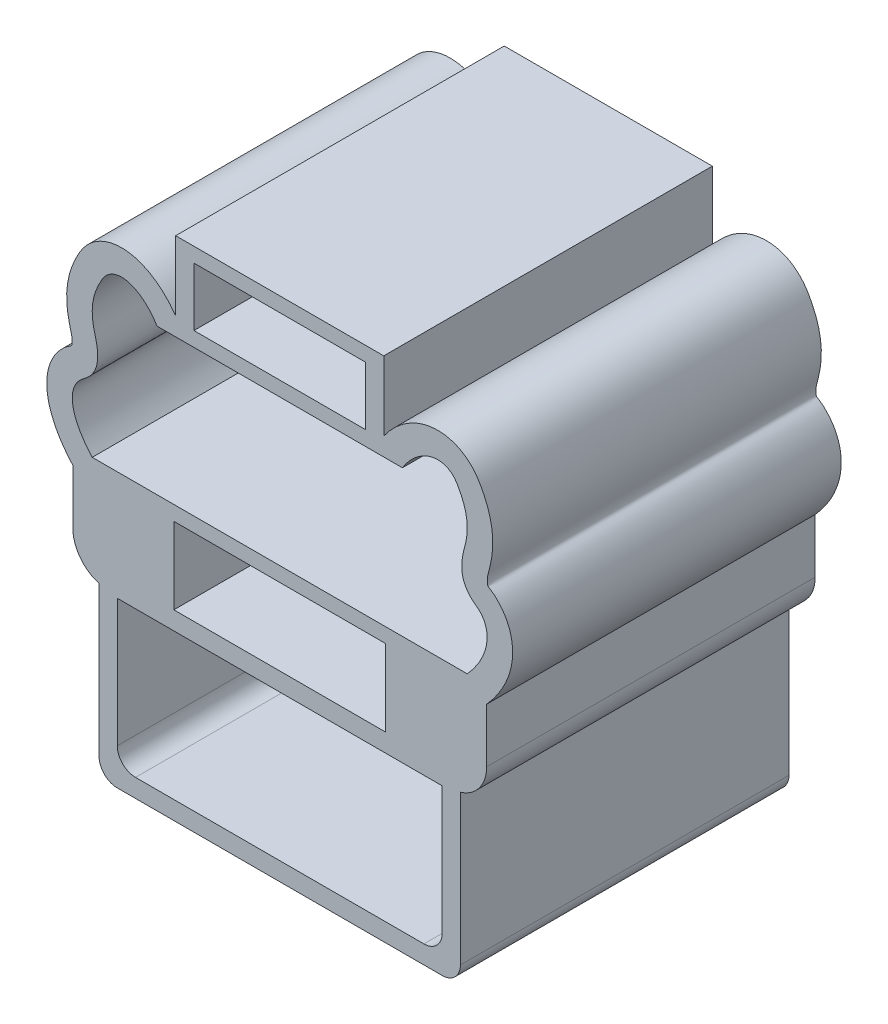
ISO-10303-21;
HEADER;
FILE_DESCRIPTION(('STEP AP214'),'2;1');
FILE_NAME('part.step','',(''),(''),'','','');
FILE_SCHEMA(('AUTOMOTIVE_DESIGN { 1 0 10303 214 1 1 1 1 }'));
ENDSEC;
DATA;
#1=APPLICATION_CONTEXT('core data for automotive mechanical design processes');
#2=APPLICATION_PROTOCOL_DEFINITION('international standard','automotive_design',2000,#1);
#3=PRODUCT_CONTEXT('',#1,'mechanical');
#4=PRODUCT('Part','Part','',(#3));
#5=PRODUCT_RELATED_PRODUCT_CATEGORY('part','',(#4));
#6=PRODUCT_DEFINITION_FORMATION('','',#4);
#7=PRODUCT_DEFINITION_CONTEXT('part definition',#1,'design');
#8=PRODUCT_DEFINITION('design','',#6,#7);
#9=PRODUCT_DEFINITION_SHAPE('','',#8);
#10=(LENGTH_UNIT() NAMED_UNIT(*) SI_UNIT(.MILLI.,.METRE.));
#11=(NAMED_UNIT(*) PLANE_ANGLE_UNIT() SI_UNIT($,.RADIAN.));
#12=(NAMED_UNIT(*) SI_UNIT($,.STERADIAN.) SOLID_ANGLE_UNIT());
#13=UNCERTAINTY_MEASURE_WITH_UNIT(LENGTH_MEASURE(1.E-05),#10,'distance_accuracy_value','');
#14=(GEOMETRIC_REPRESENTATION_CONTEXT(3) GLOBAL_UNCERTAINTY_ASSIGNED_CONTEXT((#13)) GLOBAL_UNIT_ASSIGNED_CONTEXT((#10,
#11,#12)) REPRESENTATION_CONTEXT('',''));
#15=CARTESIAN_POINT('',(0.,0.,0.));
#16=DIRECTION('',(0.,0.,1.));
#17=DIRECTION('',(1.,0.,0.));
#18=AXIS2_PLACEMENT_3D('',#15,#16,#17);
#19=CARTESIAN_POINT('',(0.,0.,9.));
#20=CARTESIAN_POINT('',(-0.0448449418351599,0.0508124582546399,9.));
#21=CARTESIAN_POINT('',(-0.0896898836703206,0.101624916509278,9.));
#22=CARTESIAN_POINT('',(-0.132153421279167,0.154398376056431,9.));
#23=CARTESIAN_POINT('',(-0.174039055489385,0.206453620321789,9.));
#24=CARTESIAN_POINT('',(-0.213607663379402,0.26041685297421,9.));
#25=CARTESIAN_POINT('',(-0.250990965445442,0.315843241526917,9.));
#26=CARTESIAN_POINT('',(-0.287378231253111,0.369792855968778,9.));
#27=CARTESIAN_POINT('',(-0.321695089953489,0.425128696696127,9.));
#28=CARTESIAN_POINT('',(-0.353266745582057,0.482016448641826,9.));
#29=CARTESIAN_POINT('',(-0.38359362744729,0.536661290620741,9.));
#30=CARTESIAN_POINT('',(-0.411387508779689,0.592738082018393,9.));
#31=CARTESIAN_POINT('',(-0.436014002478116,0.650193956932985,9.));
#32=CARTESIAN_POINT('',(-0.459383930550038,0.704718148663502,9.));
#33=CARTESIAN_POINT('',(-0.479901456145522,0.760484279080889,9.));
#34=CARTESIAN_POINT('',(-0.496758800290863,0.817368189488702,9.));
#35=CARTESIAN_POINT('',(-0.51260297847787,0.870833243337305,9.));
#36=CARTESIAN_POINT('',(-0.525213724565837,0.925285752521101,9.));
#37=CARTESIAN_POINT('',(-0.533712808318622,0.980410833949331,9.));
#38=CARTESIAN_POINT('',(-0.541660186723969,1.03195755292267,9.));
#39=CARTESIAN_POINT('',(-0.546012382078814,1.08409236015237,9.));
#40=CARTESIAN_POINT('',(-0.545917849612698,1.1362595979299,9.));
#41=CARTESIAN_POINT('',(-0.545829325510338,1.18511115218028,9.));
#42=CARTESIAN_POINT('',(-0.541841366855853,1.23399114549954,9.));
#43=CARTESIAN_POINT('',(-0.533320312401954,1.2821066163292,9.));
#44=CARTESIAN_POINT('',(-0.525265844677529,1.32758743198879,9.));
#45=CARTESIAN_POINT('',(-0.513161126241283,1.37238515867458,9.));
#46=CARTESIAN_POINT('',(-0.496764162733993,1.41556472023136,9.));
#47=CARTESIAN_POINT('',(-0.481008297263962,1.45705602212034,9.));
#48=CARTESIAN_POINT('',(-0.461289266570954,1.49705322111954,9.));
#49=CARTESIAN_POINT('',(-0.437904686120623,1.53479129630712,9.));
#50=CARTESIAN_POINT('',(-0.414984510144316,1.57177991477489,9.));
#51=CARTESIAN_POINT('',(-0.388542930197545,1.6065982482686,9.));
#52=CARTESIAN_POINT('',(-0.359057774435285,1.63855711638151,9.));
#53=CARTESIAN_POINT('',(-0.329631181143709,1.6704525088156,9.));
#54=CARTESIAN_POINT('',(-0.297173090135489,1.69949978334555,9.));
#55=CARTESIAN_POINT('',(-0.263008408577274,1.72625717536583,9.));
#56=CARTESIAN_POINT('',(-0.229579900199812,1.7524380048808,9.));
#57=CARTESIAN_POINT('',(-0.194517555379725,1.77642657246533,9.));
#58=CARTESIAN_POINT('',(-0.161632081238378,1.80318855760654,9.));
#59=CARTESIAN_POINT('',(-0.131627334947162,1.8276062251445,9.));
#60=CARTESIAN_POINT('',(-0.103434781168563,1.85433269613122,9.));
#61=CARTESIAN_POINT('',(-0.076888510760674,1.88256722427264,9.));
#62=CARTESIAN_POINT('',(-0.0522827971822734,1.9087377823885,9.));
#63=CARTESIAN_POINT('',(-0.0290914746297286,1.93620397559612,9.));
#64=CARTESIAN_POINT('',(-0.0078429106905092,1.96512652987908,9.));
#65=CARTESIAN_POINT('',(0.0122884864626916,1.99252844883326,9.));
#66=CARTESIAN_POINT('',(0.0306760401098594,2.02123761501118,9.));
#67=CARTESIAN_POINT('',(0.0471055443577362,2.05102185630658,9.));
#68=CARTESIAN_POINT('',(0.0630315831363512,2.07989338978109,9.));
#69=CARTESIAN_POINT('',(0.0771177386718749,2.10977511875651,9.));
#70=CARTESIAN_POINT('',(0.0892588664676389,2.14042526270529,9.));
#71=CARTESIAN_POINT('',(0.101289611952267,2.17079674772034,9.));
#72=CARTESIAN_POINT('',(0.111410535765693,2.2019227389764,9.));
#73=CARTESIAN_POINT('',(0.119676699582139,2.23352621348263,9.));
#74=CARTESIAN_POINT('',(0.128028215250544,2.26545600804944,9.));
#75=CARTESIAN_POINT('',(0.134486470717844,2.29787319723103,9.));
#76=CARTESIAN_POINT('',(0.139219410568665,2.33053261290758,9.));
#77=CARTESIAN_POINT('',(0.144077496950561,2.36405559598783,9.));
#78=CARTESIAN_POINT('',(0.147117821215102,2.39783378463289,9.));
#79=CARTESIAN_POINT('',(0.148581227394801,2.43167213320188,9.));
#80=CARTESIAN_POINT('',(0.150101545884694,2.46682646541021,9.));
#81=CARTESIAN_POINT('',(0.149919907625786,2.50204572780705,9.));
#82=CARTESIAN_POINT('',(0.148315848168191,2.53719383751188,9.));
#83=CARTESIAN_POINT('',(0.146634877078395,2.57402723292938,9.));
#84=CARTESIAN_POINT('',(0.143391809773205,2.61078248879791,9.));
#85=CARTESIAN_POINT('',(0.13885626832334,2.64737011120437,9.));
#86=CARTESIAN_POINT('',(0.134074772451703,2.68594181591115,9.));
#87=CARTESIAN_POINT('',(0.127856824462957,2.72432721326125,9.));
#88=CARTESIAN_POINT('',(0.120530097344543,2.76249892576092,9.));
#89=CARTESIAN_POINT('',(0.112775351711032,2.80290058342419,9.));
#90=CARTESIAN_POINT('',(0.103778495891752,2.84306286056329,9.));
#91=CARTESIAN_POINT('',(0.0935712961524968,2.88290647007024,9.));
#92=CARTESIAN_POINT('',(0.0829075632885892,2.92453214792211,9.));
#93=CARTESIAN_POINT('',(0.0709227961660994,2.96581001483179,9.));
#94=CARTESIAN_POINT('',(0.060255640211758,3.00743429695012,9.));
#95=CARTESIAN_POINT('',(0.0500535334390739,3.04724391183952,9.));
#96=CARTESIAN_POINT('',(0.041056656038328,3.08737039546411,9.));
#97=CARTESIAN_POINT('',(0.033219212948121,3.12772077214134,9.));
#98=CARTESIAN_POINT('',(0.0257628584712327,3.16610914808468,9.));
#99=CARTESIAN_POINT('',(0.0193559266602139,3.20470017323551,9.));
#100=CARTESIAN_POINT('',(0.0142149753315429,3.24346370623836,9.));
#101=CARTESIAN_POINT('',(0.009266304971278,3.28077741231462,9.));
#102=CARTESIAN_POINT('',(0.0054906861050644,3.31825096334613,9.));
#103=CARTESIAN_POINT('',(0.0030036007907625,3.35581147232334,9.));
#104=CARTESIAN_POINT('',(0.0005785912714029,3.39243449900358,9.));
#105=CARTESIAN_POINT('',(-0.0006214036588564,3.42914019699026,9.));
#106=CARTESIAN_POINT('',(-0.0005025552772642,3.46584336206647,9.));
#107=CARTESIAN_POINT('',(-0.0003850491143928,3.50213201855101,9.));
#108=CARTESIAN_POINT('',(0.0010216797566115,3.53841819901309,9.));
#109=CARTESIAN_POINT('',(0.0037583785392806,3.57460438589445,9.));
#110=CARTESIAN_POINT('',(0.0065045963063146,3.61091643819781,9.));
#111=CARTESIAN_POINT('',(0.0105900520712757,3.64712780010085,9.));
#112=CARTESIAN_POINT('',(0.0160029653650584,3.6831389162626,9.));
#113=CARTESIAN_POINT('',(0.0215193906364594,3.71983867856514,9.));
#114=CARTESIAN_POINT('',(0.0284145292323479,3.75633046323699,9.));
#115=CARTESIAN_POINT('',(0.0366155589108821,3.79252549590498,9.));
#116=CARTESIAN_POINT('',(0.0451063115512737,3.82999921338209,9.));
#117=CARTESIAN_POINT('',(0.0549968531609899,3.86715484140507,9.));
#118=CARTESIAN_POINT('',(0.0661706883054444,3.90391535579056,9.));
#119=CARTESIAN_POINT('',(0.0779228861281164,3.94257861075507,9.));
#120=CARTESIAN_POINT('',(0.0910946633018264,3.98080479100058,9.));
#121=CARTESIAN_POINT('',(0.105467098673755,4.01857774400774,9.));
#122=CARTESIAN_POINT('',(0.120818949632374,4.05892475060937,9.));
#123=CARTESIAN_POINT('',(0.137540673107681,4.09875465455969,9.));
#124=CARTESIAN_POINT('',(0.155577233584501,4.137956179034,9.));
#125=CARTESIAN_POINT('',(0.17513469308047,4.18046329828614,9.));
#126=CARTESIAN_POINT('',(0.196238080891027,4.22223159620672,9.));
#127=CARTESIAN_POINT('',(0.217918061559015,4.26374143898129,9.));
#128=CARTESIAN_POINT('',(0.241662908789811,4.30920480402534,9.));
#129=CARTESIAN_POINT('',(0.266099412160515,4.35435813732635,9.));
#130=CARTESIAN_POINT('',(0.29465608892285,4.39698002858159,9.));
#131=CARTESIAN_POINT('',(0.323364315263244,4.43982811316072,9.));
#132=CARTESIAN_POINT('',(0.356236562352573,4.48011781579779,9.));
#133=CARTESIAN_POINT('',(0.393739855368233,4.51561917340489,9.));
#134=CARTESIAN_POINT('',(0.430346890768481,4.55027211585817,9.));
#135=CARTESIAN_POINT('',(0.471366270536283,4.5803628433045,9.));
#136=CARTESIAN_POINT('',(0.515612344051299,4.60456631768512,9.));
#137=CARTESIAN_POINT('',(0.559593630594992,4.62862494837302,9.));
#138=CARTESIAN_POINT('',(0.606763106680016,4.64686657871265,9.));
#139=CARTESIAN_POINT('',(0.65543557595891,4.65880940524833,9.));
#140=CARTESIAN_POINT('',(0.704858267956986,4.6709363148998,9.));
#141=CARTESIAN_POINT('',(0.755830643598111,4.67656874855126,9.));
#142=CARTESIAN_POINT('',(0.806705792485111,4.67638524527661,9.));
#143=CARTESIAN_POINT('',(0.859000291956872,4.6761966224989,9.));
#144=CARTESIAN_POINT('',(0.911192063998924,4.66986302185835,9.));
#145=CARTESIAN_POINT('',(0.962228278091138,4.65859686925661,9.));
#146=CARTESIAN_POINT('',(1.01459481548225,4.64703705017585,9.));
#147=CARTESIAN_POINT('',(1.06574476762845,4.63028418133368,9.));
#148=CARTESIAN_POINT('',(1.11517051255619,4.60954149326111,9.));
#149=CARTESIAN_POINT('',(1.16524397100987,4.58852697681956,9.));
#150=CARTESIAN_POINT('',(1.2135477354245,4.56341738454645,9.));
#151=CARTESIAN_POINT('',(1.25989671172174,4.53515962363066,9.));
#152=CARTESIAN_POINT('',(1.30601279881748,4.5070438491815,9.));
#153=CARTESIAN_POINT('',(1.35019369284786,4.47581146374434,9.));
#154=CARTESIAN_POINT('',(1.39241333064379,4.44214210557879,9.));
#155=CARTESIAN_POINT('',(1.43363020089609,4.40927243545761,9.));
#156=CARTESIAN_POINT('',(1.47297787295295,4.37408017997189,9.));
#157=CARTESIAN_POINT('',(1.51042136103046,4.33699160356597,9.));
#158=CARTESIAN_POINT('',(1.54634374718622,4.30140971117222,9.));
#159=CARTESIAN_POINT('',(1.58051351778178,4.264082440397,9.));
#160=CARTESIAN_POINT('',(1.61308752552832,4.22539575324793,9.));
#161=CARTESIAN_POINT('',(1.64388004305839,4.18882486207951,9.));
#162=CARTESIAN_POINT('',(1.67324657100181,4.15103918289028,9.));
#163=CARTESIAN_POINT('',(1.70068073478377,4.11192736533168,9.));
#164=CARTESIAN_POINT('',(1.72630925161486,4.07538978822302,9.));
#165=CARTESIAN_POINT('',(1.75025140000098,4.03769489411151,9.));
#166=CARTESIAN_POINT('',(1.7741935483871,4.,9.));
#167=B_SPLINE_CURVE_WITH_KNOTS('',3,(#19,#20,#21,#22,#23,#24,#25,#26,#27,#28,#29,#30,#31,#32,
#33,#34,#35,#36,#37,#38,#39,#40,#41,#42,#43,#44,#45,#46,#47,#48,#49,#50,#51,#52,#53,#54,#55,#56,
#57,#58,#59,#60,#61,#62,#63,#64,#65,#66,#67,#68,#69,#70,#71,#72,#73,#74,#75,#76,#77,#78,#79,#80,
#81,#82,#83,#84,#85,#86,#87,#88,#89,#90,#91,#92,#93,#94,#95,#96,#97,#98,#99,#100,#101,#102,#103,
#104,#105,#106,#107,#108,#109,#110,#111,#112,#113,#114,#115,#116,#117,#118,#119,#120,#121,#122,
#123,#124,#125,#126,#127,#128,#129,#130,#131,#132,#133,#134,#135,#136,#137,#138,#139,#140,#141,
#142,#143,#144,#145,#146,#147,#148,#149,#150,#151,#152,#153,#154,#155,#156,#157,#158,#159,#160,
#161,#162,#163,#164,#165,#166),.UNSPECIFIED.,.F.,.F.,(4,3,3,3,3,3,3,3,3,3,3,3,3,3,3,3,3,3,3,3,3,
3,3,3,3,3,3,3,3,3,3,3,3,3,3,3,3,3,3,3,3,3,3,3,3,3,3,3,3,4),(0.,0.20323234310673,0.4036988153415,
0.59882408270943,0.78625615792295,0.96412452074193,1.13130257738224,1.28762851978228,
1.43401858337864,1.57239277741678,1.70535673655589,1.83568010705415,1.96574463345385,
2.0930065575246,2.20912049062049,2.31674638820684,2.41871373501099,2.51755639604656,
2.61550041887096,2.71445575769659,2.81602763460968,2.92154967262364,3.03213129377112,
3.14870956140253,3.2720981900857,3.40100557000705,3.52429305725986,3.64158580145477,
3.75449158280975,3.86457932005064,3.97342377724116,4.08264682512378,4.19395856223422,
4.30920267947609,4.43041188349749,4.55988093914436,4.70026722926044,4.85402433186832,
5.00859741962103,5.15947650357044,5.30945266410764,5.46174051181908,5.61827699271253,
5.77889379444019,5.94161544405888,6.10351946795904,6.26157807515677,6.41321571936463,
6.55656021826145,6.6904701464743),.UNSPECIFIED.);
#168=DIRECTION('',(0.,0.,-1.));
#169=VECTOR('',#168,1.);
#170=SURFACE_OF_LINEAR_EXTRUSION('',#167,#169);
#171=CARTESIAN_POINT('',(0.,0.,0.));
#172=CARTESIAN_POINT('',(-0.0448449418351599,0.0508124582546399,0.));
#173=CARTESIAN_POINT('',(-0.0896898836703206,0.101624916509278,0.));
#174=CARTESIAN_POINT('',(-0.132153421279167,0.154398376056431,0.));
#175=CARTESIAN_POINT('',(-0.174039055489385,0.206453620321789,0.));
#176=CARTESIAN_POINT('',(-0.213607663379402,0.26041685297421,0.));
#177=CARTESIAN_POINT('',(-0.250990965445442,0.315843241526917,0.));
#178=CARTESIAN_POINT('',(-0.287378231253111,0.369792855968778,0.));
#179=CARTESIAN_POINT('',(-0.321695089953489,0.425128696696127,0.));
#180=CARTESIAN_POINT('',(-0.353266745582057,0.482016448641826,0.));
#181=CARTESIAN_POINT('',(-0.38359362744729,0.536661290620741,0.));
#182=CARTESIAN_POINT('',(-0.411387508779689,0.592738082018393,0.));
#183=CARTESIAN_POINT('',(-0.436014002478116,0.650193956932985,0.));
#184=CARTESIAN_POINT('',(-0.459383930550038,0.704718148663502,0.));
#185=CARTESIAN_POINT('',(-0.479901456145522,0.760484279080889,0.));
#186=CARTESIAN_POINT('',(-0.496758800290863,0.817368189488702,0.));
#187=CARTESIAN_POINT('',(-0.51260297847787,0.870833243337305,0.));
#188=CARTESIAN_POINT('',(-0.525213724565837,0.925285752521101,0.));
#189=CARTESIAN_POINT('',(-0.533712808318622,0.980410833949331,0.));
#190=CARTESIAN_POINT('',(-0.541660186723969,1.03195755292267,0.));
#191=CARTESIAN_POINT('',(-0.546012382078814,1.08409236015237,0.));
#192=CARTESIAN_POINT('',(-0.545917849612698,1.1362595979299,0.));
#193=CARTESIAN_POINT('',(-0.545829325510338,1.18511115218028,0.));
#194=CARTESIAN_POINT('',(-0.541841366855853,1.23399114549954,0.));
#195=CARTESIAN_POINT('',(-0.533320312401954,1.2821066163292,0.));
#196=CARTESIAN_POINT('',(-0.525265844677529,1.32758743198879,0.));
#197=CARTESIAN_POINT('',(-0.513161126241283,1.37238515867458,0.));
#198=CARTESIAN_POINT('',(-0.496764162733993,1.41556472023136,0.));
#199=CARTESIAN_POINT('',(-0.481008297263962,1.45705602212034,0.));
#200=CARTESIAN_POINT('',(-0.461289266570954,1.49705322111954,0.));
#201=CARTESIAN_POINT('',(-0.437904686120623,1.53479129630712,0.));
#202=CARTESIAN_POINT('',(-0.414984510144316,1.57177991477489,0.));
#203=CARTESIAN_POINT('',(-0.388542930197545,1.6065982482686,0.));
#204=CARTESIAN_POINT('',(-0.359057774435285,1.63855711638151,0.));
#205=CARTESIAN_POINT('',(-0.329631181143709,1.6704525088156,0.));
#206=CARTESIAN_POINT('',(-0.297173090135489,1.69949978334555,0.));
#207=CARTESIAN_POINT('',(-0.263008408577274,1.72625717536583,0.));
#208=CARTESIAN_POINT('',(-0.229579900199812,1.7524380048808,0.));
#209=CARTESIAN_POINT('',(-0.194517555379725,1.77642657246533,0.));
#210=CARTESIAN_POINT('',(-0.161632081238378,1.80318855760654,0.));
#211=CARTESIAN_POINT('',(-0.131627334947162,1.8276062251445,0.));
#212=CARTESIAN_POINT('',(-0.103434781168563,1.85433269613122,0.));
#213=CARTESIAN_POINT('',(-0.076888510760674,1.88256722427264,0.));
#214=CARTESIAN_POINT('',(-0.0522827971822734,1.9087377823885,0.));
#215=CARTESIAN_POINT('',(-0.0290914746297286,1.93620397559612,0.));
#216=CARTESIAN_POINT('',(-0.0078429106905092,1.96512652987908,0.));
#217=CARTESIAN_POINT('',(0.0122884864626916,1.99252844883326,0.));
#218=CARTESIAN_POINT('',(0.0306760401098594,2.02123761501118,0.));
#219=CARTESIAN_POINT('',(0.0471055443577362,2.05102185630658,0.));
#220=CARTESIAN_POINT('',(0.0630315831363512,2.07989338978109,0.));
#221=CARTESIAN_POINT('',(0.0771177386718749,2.10977511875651,0.));
#222=CARTESIAN_POINT('',(0.0892588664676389,2.14042526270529,0.));
#223=CARTESIAN_POINT('',(0.101289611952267,2.17079674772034,0.));
#224=CARTESIAN_POINT('',(0.111410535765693,2.2019227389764,0.));
#225=CARTESIAN_POINT('',(0.119676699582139,2.23352621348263,0.));
#226=CARTESIAN_POINT('',(0.128028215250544,2.26545600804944,0.));
#227=CARTESIAN_POINT('',(0.134486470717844,2.29787319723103,0.));
#228=CARTESIAN_POINT('',(0.139219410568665,2.33053261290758,0.));
#229=CARTESIAN_POINT('',(0.144077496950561,2.36405559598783,0.));
#230=CARTESIAN_POINT('',(0.147117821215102,2.39783378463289,0.));
#231=CARTESIAN_POINT('',(0.148581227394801,2.43167213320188,0.));
#232=CARTESIAN_POINT('',(0.150101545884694,2.46682646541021,0.));
#233=CARTESIAN_POINT('',(0.149919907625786,2.50204572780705,0.));
#234=CARTESIAN_POINT('',(0.148315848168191,2.53719383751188,0.));
#235=CARTESIAN_POINT('',(0.146634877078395,2.57402723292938,0.));
#236=CARTESIAN_POINT('',(0.143391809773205,2.61078248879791,0.));
#237=CARTESIAN_POINT('',(0.13885626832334,2.64737011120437,0.));
#238=CARTESIAN_POINT('',(0.134074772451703,2.68594181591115,0.));
#239=CARTESIAN_POINT('',(0.127856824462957,2.72432721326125,0.));
#240=CARTESIAN_POINT('',(0.120530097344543,2.76249892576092,0.));
#241=CARTESIAN_POINT('',(0.112775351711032,2.80290058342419,0.));
#242=CARTESIAN_POINT('',(0.103778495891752,2.84306286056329,0.));
#243=CARTESIAN_POINT('',(0.0935712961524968,2.88290647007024,0.));
#244=CARTESIAN_POINT('',(0.0829075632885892,2.92453214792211,0.));
#245=CARTESIAN_POINT('',(0.0709227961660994,2.96581001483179,0.));
#246=CARTESIAN_POINT('',(0.060255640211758,3.00743429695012,0.));
#247=CARTESIAN_POINT('',(0.0500535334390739,3.04724391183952,0.));
#248=CARTESIAN_POINT('',(0.041056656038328,3.08737039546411,0.));
#249=CARTESIAN_POINT('',(0.033219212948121,3.12772077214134,0.));
#250=CARTESIAN_POINT('',(0.0257628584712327,3.16610914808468,0.));
#251=CARTESIAN_POINT('',(0.0193559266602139,3.20470017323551,0.));
#252=CARTESIAN_POINT('',(0.0142149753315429,3.24346370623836,0.));
#253=CARTESIAN_POINT('',(0.009266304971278,3.28077741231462,0.));
#254=CARTESIAN_POINT('',(0.0054906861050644,3.31825096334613,0.));
#255=CARTESIAN_POINT('',(0.0030036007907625,3.35581147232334,0.));
#256=CARTESIAN_POINT('',(0.0005785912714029,3.39243449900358,0.));
#257=CARTESIAN_POINT('',(-0.0006214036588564,3.42914019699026,0.));
#258=CARTESIAN_POINT('',(-0.0005025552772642,3.46584336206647,0.));
#259=CARTESIAN_POINT('',(-0.0003850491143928,3.50213201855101,0.));
#260=CARTESIAN_POINT('',(0.0010216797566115,3.53841819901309,0.));
#261=CARTESIAN_POINT('',(0.0037583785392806,3.57460438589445,0.));
#262=CARTESIAN_POINT('',(0.0065045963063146,3.61091643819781,0.));
#263=CARTESIAN_POINT('',(0.0105900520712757,3.64712780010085,0.));
#264=CARTESIAN_POINT('',(0.0160029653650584,3.6831389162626,0.));
#265=CARTESIAN_POINT('',(0.0215193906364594,3.71983867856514,0.));
#266=CARTESIAN_POINT('',(0.0284145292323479,3.75633046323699,0.));
#267=CARTESIAN_POINT('',(0.0366155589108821,3.79252549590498,0.));
#268=CARTESIAN_POINT('',(0.0451063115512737,3.82999921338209,0.));
#269=CARTESIAN_POINT('',(0.0549968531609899,3.86715484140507,0.));
#270=CARTESIAN_POINT('',(0.0661706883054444,3.90391535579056,0.));
#271=CARTESIAN_POINT('',(0.0779228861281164,3.94257861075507,0.));
#272=CARTESIAN_POINT('',(0.0910946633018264,3.98080479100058,0.));
#273=CARTESIAN_POINT('',(0.105467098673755,4.01857774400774,0.));
#274=CARTESIAN_POINT('',(0.120818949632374,4.05892475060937,0.));
#275=CARTESIAN_POINT('',(0.137540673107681,4.09875465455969,0.));
#276=CARTESIAN_POINT('',(0.155577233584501,4.137956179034,0.));
#277=CARTESIAN_POINT('',(0.17513469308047,4.18046329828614,0.));
#278=CARTESIAN_POINT('',(0.196238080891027,4.22223159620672,0.));
#279=CARTESIAN_POINT('',(0.217918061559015,4.26374143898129,0.));
#280=CARTESIAN_POINT('',(0.241662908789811,4.30920480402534,0.));
#281=CARTESIAN_POINT('',(0.266099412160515,4.35435813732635,0.));
#282=CARTESIAN_POINT('',(0.29465608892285,4.39698002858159,0.));
#283=CARTESIAN_POINT('',(0.323364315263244,4.43982811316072,0.));
#284=CARTESIAN_POINT('',(0.356236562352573,4.48011781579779,0.));
#285=CARTESIAN_POINT('',(0.393739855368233,4.51561917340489,0.));
#286=CARTESIAN_POINT('',(0.430346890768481,4.55027211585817,0.));
#287=CARTESIAN_POINT('',(0.471366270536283,4.5803628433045,0.));
#288=CARTESIAN_POINT('',(0.515612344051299,4.60456631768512,0.));
#289=CARTESIAN_POINT('',(0.559593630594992,4.62862494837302,0.));
#290=CARTESIAN_POINT('',(0.606763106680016,4.64686657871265,0.));
#291=CARTESIAN_POINT('',(0.65543557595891,4.65880940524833,0.));
#292=CARTESIAN_POINT('',(0.704858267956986,4.6709363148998,0.));
#293=CARTESIAN_POINT('',(0.755830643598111,4.67656874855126,0.));
#294=CARTESIAN_POINT('',(0.806705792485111,4.67638524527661,0.));
#295=CARTESIAN_POINT('',(0.859000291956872,4.6761966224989,0.));
#296=CARTESIAN_POINT('',(0.911192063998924,4.66986302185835,0.));
#297=CARTESIAN_POINT('',(0.962228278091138,4.65859686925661,0.));
#298=CARTESIAN_POINT('',(1.01459481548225,4.64703705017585,0.));
#299=CARTESIAN_POINT('',(1.06574476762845,4.63028418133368,0.));
#300=CARTESIAN_POINT('',(1.11517051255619,4.60954149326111,0.));
#301=CARTESIAN_POINT('',(1.16524397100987,4.58852697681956,0.));
#302=CARTESIAN_POINT('',(1.2135477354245,4.56341738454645,0.));
#303=CARTESIAN_POINT('',(1.25989671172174,4.53515962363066,0.));
#304=CARTESIAN_POINT('',(1.30601279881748,4.5070438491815,0.));
#305=CARTESIAN_POINT('',(1.35019369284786,4.47581146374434,0.));
#306=CARTESIAN_POINT('',(1.39241333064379,4.44214210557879,0.));
#307=CARTESIAN_POINT('',(1.43363020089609,4.40927243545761,0.));
#308=CARTESIAN_POINT('',(1.47297787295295,4.37408017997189,0.));
#309=CARTESIAN_POINT('',(1.51042136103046,4.33699160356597,0.));
#310=CARTESIAN_POINT('',(1.54634374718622,4.30140971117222,0.));
#311=CARTESIAN_POINT('',(1.58051351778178,4.264082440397,0.));
#312=CARTESIAN_POINT('',(1.61308752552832,4.22539575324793,0.));
#313=CARTESIAN_POINT('',(1.64388004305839,4.18882486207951,0.));
#314=CARTESIAN_POINT('',(1.67324657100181,4.15103918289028,0.));
#315=CARTESIAN_POINT('',(1.70068073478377,4.11192736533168,0.));
#316=CARTESIAN_POINT('',(1.72630925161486,4.07538978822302,0.));
#317=CARTESIAN_POINT('',(1.75025140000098,4.03769489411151,0.));
#318=CARTESIAN_POINT('',(1.7741935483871,4.,0.));
#319=B_SPLINE_CURVE_WITH_KNOTS('',3,(#171,#172,#173,#174,#175,#176,#177,#178,#179,#180,#181,
#182,#183,#184,#185,#186,#187,#188,#189,#190,#191,#192,#193,#194,#195,#196,#197,#198,#199,#200,
#201,#202,#203,#204,#205,#206,#207,#208,#209,#210,#211,#212,#213,#214,#215,#216,#217,#218,#219,
#220,#221,#222,#223,#224,#225,#226,#227,#228,#229,#230,#231,#232,#233,#234,#235,#236,#237,#238,
#239,#240,#241,#242,#243,#244,#245,#246,#247,#248,#249,#250,#251,#252,#253,#254,#255,#256,#257,
#258,#259,#260,#261,#262,#263,#264,#265,#266,#267,#268,#269,#270,#271,#272,#273,#274,#275,#276,
#277,#278,#279,#280,#281,#282,#283,#284,#285,#286,#287,#288,#289,#290,#291,#292,#293,#294,#295,
#296,#297,#298,#299,#300,#301,#302,#303,#304,#305,#306,#307,#308,#309,#310,#311,#312,#313,#314,
#315,#316,#317,#318),.UNSPECIFIED.,.F.,.F.,(4,3,3,3,3,3,3,3,3,3,3,3,3,3,3,3,3,3,3,3,3,3,3,3,3,3,
3,3,3,3,3,3,3,3,3,3,3,3,3,3,3,3,3,3,3,3,3,3,3,4),(0.,0.20323234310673,0.4036988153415,
0.59882408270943,0.78625615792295,0.96412452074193,1.13130257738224,1.28762851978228,
1.43401858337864,1.57239277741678,1.70535673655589,1.83568010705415,1.96574463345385,
2.0930065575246,2.20912049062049,2.31674638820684,2.41871373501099,2.51755639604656,
2.61550041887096,2.71445575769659,2.81602763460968,2.92154967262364,3.03213129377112,
3.14870956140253,3.2720981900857,3.40100557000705,3.52429305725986,3.64158580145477,
3.75449158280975,3.86457932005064,3.97342377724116,4.08264682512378,4.19395856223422,
4.30920267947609,4.43041188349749,4.55988093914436,4.70026722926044,4.85402433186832,
5.00859741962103,5.15947650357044,5.30945266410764,5.46174051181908,5.61827699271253,
5.77889379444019,5.94161544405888,6.10351946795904,6.26157807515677,6.41321571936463,
6.55656021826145,6.6904701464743),.UNSPECIFIED.);
#320=CARTESIAN_POINT('',(0.,0.,0.));
#321=VERTEX_POINT('',#320);
#322=CARTESIAN_POINT('',(1.7741935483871,4.,0.));
#323=VERTEX_POINT('',#322);
#324=EDGE_CURVE('E368',#321,#323,#319,.T.);
#325=ORIENTED_EDGE('',*,*,#324,.T.);
#326=DIRECTION('',(0.,0.,-1.));
#327=VECTOR('',#326,1.);
#328=CARTESIAN_POINT('',(1.7741935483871,4.,9.));
#329=LINE('',#328,#327);
#330=CARTESIAN_POINT('',(1.7741935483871,4.,9.));
#331=VERTEX_POINT('',#330);
#332=EDGE_CURVE('E431',#331,#323,#329,.T.);
#333=ORIENTED_EDGE('',*,*,#332,.F.);
#334=CARTESIAN_POINT('',(0.,0.,9.));
#335=VERTEX_POINT('',#334);
#336=EDGE_CURVE('E407',#335,#331,#167,.T.);
#337=ORIENTED_EDGE('',*,*,#336,.F.);
#338=DIRECTION('',(0.,0.,-1.));
#339=VECTOR('',#338,1.);
#340=CARTESIAN_POINT('',(0.,0.,9.));
#341=LINE('',#340,#339);
#342=EDGE_CURVE('E367',#335,#321,#341,.T.);
#343=ORIENTED_EDGE('',*,*,#342,.T.);
#344=EDGE_LOOP('',(#325,#333,#337,#343));
#345=FACE_BOUND('',#344,.T.);
#346=ADVANCED_FACE('F35',(#345),#170,.F.);
#347=CARTESIAN_POINT('',(1.7741935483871,4.,9.));
#348=DIRECTION('',(0.,1.,0.));
#349=DIRECTION('',(-1.,0.,0.));
#350=AXIS2_PLACEMENT_3D('',#347,#348,#349);
#351=PLANE('',#350);
#352=DIRECTION('',(1.,0.,0.));
#353=VECTOR('',#352,1.);
#354=CARTESIAN_POINT('',(1.7741935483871,4.,0.));
#355=LINE('',#354,#353);
#356=CARTESIAN_POINT('',(8.49734487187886,4.,0.));
#357=VERTEX_POINT('',#356);
#358=EDGE_CURVE('E373',#323,#357,#355,.T.);
#359=ORIENTED_EDGE('',*,*,#358,.T.);
#360=DIRECTION('',(0.,0.,-1.));
#361=VECTOR('',#360,1.);
#362=CARTESIAN_POINT('',(8.49734487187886,4.,9.));
#363=LINE('',#362,#361);
#364=CARTESIAN_POINT('',(8.49734487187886,4.,9.));
#365=VERTEX_POINT('',#364);
#366=EDGE_CURVE('E608',#365,#357,#363,.T.);
#367=ORIENTED_EDGE('',*,*,#366,.F.);
#368=DIRECTION('',(1.,0.,0.));
#369=VECTOR('',#368,1.);
#370=CARTESIAN_POINT('',(1.7741935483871,4.,9.));
#371=LINE('',#370,#369);
#372=EDGE_CURVE('E520',#331,#365,#371,.T.);
#373=ORIENTED_EDGE('',*,*,#372,.F.);
#374=ORIENTED_EDGE('',*,*,#332,.T.);
#375=EDGE_LOOP('',(#359,#367,#373,#374));
#376=FACE_BOUND('',#375,.T.);
#377=ADVANCED_FACE('F500',(#376),#351,.F.);
#378=CARTESIAN_POINT('',(5.13576921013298,4.4,9.));
#379=DIRECTION('',(0.,-1.,0.));
#380=DIRECTION('',(0.,0.,-1.));
#381=AXIS2_PLACEMENT_3D('',#378,#379,#380);
#382=PLANE('',#381);
#383=DIRECTION('',(-1.,0.,0.));
#384=VECTOR('',#383,1.);
#385=CARTESIAN_POINT('',(5.13576921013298,4.4,0.));
#386=LINE('',#385,#384);
#387=CARTESIAN_POINT('',(7.48576921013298,4.4,0.));
#388=VERTEX_POINT('',#387);
#389=CARTESIAN_POINT('',(2.78576921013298,4.4,0.));
#390=VERTEX_POINT('',#389);
#391=EDGE_CURVE('E379',#388,#390,#386,.T.);
#392=ORIENTED_EDGE('',*,*,#391,.T.);
#393=DIRECTION('',(0.,0.,-1.));
#394=VECTOR('',#393,1.);
#395=CARTESIAN_POINT('',(2.78576921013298,4.4,9.));
#396=LINE('',#395,#394);
#397=CARTESIAN_POINT('',(2.78576921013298,4.4,9.));
#398=VERTEX_POINT('',#397);
#399=EDGE_CURVE('E428',#398,#390,#396,.T.);
#400=ORIENTED_EDGE('',*,*,#399,.F.);
#401=DIRECTION('',(-1.,0.,0.));
#402=VECTOR('',#401,1.);
#403=CARTESIAN_POINT('',(5.13576921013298,4.4,9.));
#404=LINE('',#403,#402);
#405=CARTESIAN_POINT('',(7.48576921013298,4.4,9.));
#406=VERTEX_POINT('',#405);
#407=EDGE_CURVE('E526',#406,#398,#404,.T.);
#408=ORIENTED_EDGE('',*,*,#407,.F.);
#409=DIRECTION('',(0.,0.,-1.));
#410=VECTOR('',#409,1.);
#411=CARTESIAN_POINT('',(7.48576921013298,4.4,9.));
#412=LINE('',#411,#410);
#413=EDGE_CURVE('E611',#406,#388,#412,.T.);
#414=ORIENTED_EDGE('',*,*,#413,.T.);
#415=EDGE_LOOP('',(#392,#400,#408,#414));
#416=FACE_BOUND('',#415,.T.);
#417=ADVANCED_FACE('F506',(#416),#382,.F.);
#418=CARTESIAN_POINT('',(2.78576921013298,4.4,9.));
#419=DIRECTION('',(-1.,0.,0.));
#420=DIRECTION('',(0.,0.,1.));
#421=AXIS2_PLACEMENT_3D('',#418,#419,#420);
#422=PLANE('',#421);
#423=DIRECTION('',(0.,1.,0.));
#424=VECTOR('',#423,1.);
#425=CARTESIAN_POINT('',(2.78576921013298,4.4,0.));
#426=LINE('',#425,#424);
#427=CARTESIAN_POINT('',(2.78576921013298,6.,0.));
#428=VERTEX_POINT('',#427);
#429=EDGE_CURVE('E381',#390,#428,#426,.T.);
#430=ORIENTED_EDGE('',*,*,#429,.T.);
#431=DIRECTION('',(0.,0.,-1.));
#432=VECTOR('',#431,1.);
#433=CARTESIAN_POINT('',(2.78576921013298,6.,9.));
#434=LINE('',#433,#432);
#435=CARTESIAN_POINT('',(2.78576921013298,6.,9.));
#436=VERTEX_POINT('',#435);
#437=EDGE_CURVE('E425',#436,#428,#434,.T.);
#438=ORIENTED_EDGE('',*,*,#437,.F.);
#439=DIRECTION('',(0.,1.,0.));
#440=VECTOR('',#439,1.);
#441=CARTESIAN_POINT('',(2.78576921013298,4.4,9.));
#442=LINE('',#441,#440);
#443=EDGE_CURVE('E528',#398,#436,#442,.T.);
#444=ORIENTED_EDGE('',*,*,#443,.F.);
#445=ORIENTED_EDGE('',*,*,#399,.T.);
#446=EDGE_LOOP('',(#430,#438,#444,#445));
#447=FACE_BOUND('',#446,.T.);
#448=ADVANCED_FACE('F740',(#447),#422,.F.);
#449=CARTESIAN_POINT('',(2.78576921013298,6.,9.));
#450=DIRECTION('',(0.,1.,0.));
#451=DIRECTION('',(0.,0.,1.));
#452=AXIS2_PLACEMENT_3D('',#449,#450,#451);
#453=PLANE('',#452);
#454=DIRECTION('',(1.,0.,0.));
#455=VECTOR('',#454,1.);
#456=CARTESIAN_POINT('',(2.78576921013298,6.,0.));
#457=LINE('',#456,#455);
#458=CARTESIAN_POINT('',(7.48576921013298,6.,0.));
#459=VERTEX_POINT('',#458);
#460=EDGE_CURVE('E383',#428,#459,#457,.T.);
#461=ORIENTED_EDGE('',*,*,#460,.T.);
#462=DIRECTION('',(0.,0.,-1.));
#463=VECTOR('',#462,1.);
#464=CARTESIAN_POINT('',(7.48576921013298,6.,9.));
#465=LINE('',#464,#463);
#466=CARTESIAN_POINT('',(7.48576921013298,6.,9.));
#467=VERTEX_POINT('',#466);
#468=EDGE_CURVE('E614',#467,#459,#465,.T.);
#469=ORIENTED_EDGE('',*,*,#468,.F.);
#470=DIRECTION('',(1.,0.,0.));
#471=VECTOR('',#470,1.);
#472=CARTESIAN_POINT('',(2.78576921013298,6.,9.));
#473=LINE('',#472,#471);
#474=EDGE_CURVE('E530',#436,#467,#473,.T.);
#475=ORIENTED_EDGE('',*,*,#474,.F.);
#476=ORIENTED_EDGE('',*,*,#437,.T.);
#477=EDGE_LOOP('',(#461,#469,#475,#476));
#478=FACE_BOUND('',#477,.T.);
#479=ADVANCED_FACE('F733',(#478),#453,.F.);
#480=CARTESIAN_POINT('',(5.13576921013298,6.4,9.));
#481=DIRECTION('',(0.,-1.,0.));
#482=DIRECTION('',(0.,0.,-1.));
#483=AXIS2_PLACEMENT_3D('',#480,#481,#482);
#484=PLANE('',#483);
#485=DIRECTION('',(-1.,0.,0.));
#486=VECTOR('',#485,1.);
#487=CARTESIAN_POINT('',(5.13576921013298,6.4,0.));
#488=LINE('',#487,#486);
#489=CARTESIAN_POINT('',(7.98576921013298,6.4,0.));
#490=VERTEX_POINT('',#489);
#491=CARTESIAN_POINT('',(2.28576921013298,6.4,0.));
#492=VERTEX_POINT('',#491);
#493=EDGE_CURVE('E385',#490,#492,#488,.T.);
#494=ORIENTED_EDGE('',*,*,#493,.T.);
#495=DIRECTION('',(0.,0.,-1.));
#496=VECTOR('',#495,1.);
#497=CARTESIAN_POINT('',(2.28576921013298,6.4,9.));
#498=LINE('',#497,#496);
#499=CARTESIAN_POINT('',(2.28576921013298,6.4,9.));
#500=VERTEX_POINT('',#499);
#501=EDGE_CURVE('E422',#500,#492,#498,.T.);
#502=ORIENTED_EDGE('',*,*,#501,.F.);
#503=DIRECTION('',(-1.,0.,0.));
#504=VECTOR('',#503,1.);
#505=CARTESIAN_POINT('',(5.13576921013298,6.4,9.));
#506=LINE('',#505,#504);
#507=CARTESIAN_POINT('',(7.98576921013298,6.4,9.));
#508=VERTEX_POINT('',#507);
#509=EDGE_CURVE('E531',#508,#500,#506,.T.);
#510=ORIENTED_EDGE('',*,*,#509,.F.);
#511=DIRECTION('',(0.,0.,-1.));
#512=VECTOR('',#511,1.);
#513=CARTESIAN_POINT('',(7.98576921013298,6.4,9.));
#514=LINE('',#513,#512);
#515=EDGE_CURVE('E617',#508,#490,#514,.T.);
#516=ORIENTED_EDGE('',*,*,#515,.T.);
#517=EDGE_LOOP('',(#494,#502,#510,#516));
#518=FACE_BOUND('',#517,.T.);
#519=ADVANCED_FACE('F727',(#518),#484,.F.);
#520=CARTESIAN_POINT('',(2.28576921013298,6.4,9.));
#521=DIRECTION('',(1.,0.,0.));
#522=DIRECTION('',(0.,1.,0.));
#523=AXIS2_PLACEMENT_3D('',#520,#521,#522);
#524=PLANE('',#523);
#525=DIRECTION('',(0.,-1.,0.));
#526=VECTOR('',#525,1.);
#527=CARTESIAN_POINT('',(2.28576921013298,6.4,0.));
#528=LINE('',#527,#526);
#529=CARTESIAN_POINT('',(2.28576921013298,4.49620783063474,0.));
#530=VERTEX_POINT('',#529);
#531=EDGE_CURVE('E387',#492,#530,#528,.T.);
#532=ORIENTED_EDGE('',*,*,#531,.T.);
#533=DIRECTION('',(0.,0.,-1.));
#534=VECTOR('',#533,1.);
#535=CARTESIAN_POINT('',(2.28576921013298,4.49620783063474,9.));
#536=LINE('',#535,#534);
#537=CARTESIAN_POINT('',(2.28576921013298,4.49620783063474,9.));
#538=VERTEX_POINT('',#537);
#539=EDGE_CURVE('E419',#538,#530,#536,.T.);
#540=ORIENTED_EDGE('',*,*,#539,.F.);
#541=DIRECTION('',(0.,-1.,0.));
#542=VECTOR('',#541,1.);
#543=CARTESIAN_POINT('',(2.28576921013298,6.4,9.));
#544=LINE('',#543,#542);
#545=EDGE_CURVE('E352',#500,#538,#544,.T.);
#546=ORIENTED_EDGE('',*,*,#545,.F.);
#547=ORIENTED_EDGE('',*,*,#501,.T.);
#548=EDGE_LOOP('',(#532,#540,#546,#547));
#549=FACE_BOUND('',#548,.T.);
#550=ADVANCED_FACE('F342',(#549),#524,.F.);
#551=CARTESIAN_POINT('',(2.28576921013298,4.49620783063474,9.));
#552=CARTESIAN_POINT('',(2.24710857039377,4.54920414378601,9.));
#553=CARTESIAN_POINT('',(2.20844793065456,4.60220045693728,9.));
#554=CARTESIAN_POINT('',(2.16719230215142,4.65314322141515,9.));
#555=CARTESIAN_POINT('',(2.12272366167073,4.70805343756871,9.));
#556=CARTESIAN_POINT('',(2.07524009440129,4.76057778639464,9.));
#557=CARTESIAN_POINT('',(2.02557771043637,4.81092613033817,9.));
#558=CARTESIAN_POINT('',(1.97230808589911,4.86493153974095,9.));
#559=CARTESIAN_POINT('',(1.9165316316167,4.91643335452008,9.));
#560=CARTESIAN_POINT('',(1.85809724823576,4.96476863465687,9.));
#561=CARTESIAN_POINT('',(1.79569774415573,5.01638375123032,9.));
#562=CARTESIAN_POINT('',(1.73026736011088,5.06438801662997,9.));
#563=CARTESIAN_POINT('',(1.66206252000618,5.10810173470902,9.));
#564=CARTESIAN_POINT('',(1.58943366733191,5.15465088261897,9.));
#565=CARTESIAN_POINT('',(1.51365876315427,5.19633483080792,9.));
#566=CARTESIAN_POINT('',(1.43514827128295,5.23212822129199,9.));
#567=CARTESIAN_POINT('',(1.35156155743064,5.27023589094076,9.));
#568=CARTESIAN_POINT('',(1.2648740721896,5.30166665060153,9.));
#569=CARTESIAN_POINT('',(1.17602137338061,5.3251495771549,9.));
#570=CARTESIAN_POINT('',(1.08129785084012,5.35018410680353,9.));
#571=CARTESIAN_POINT('',(0.984113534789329,5.36618582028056,9.));
#572=CARTESIAN_POINT('',(0.886251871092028,5.37185086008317,9.));
#573=CARTESIAN_POINT('',(0.782188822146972,5.3778748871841,9.));
#574=CARTESIAN_POINT('',(0.677359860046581,5.37221068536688,9.));
#575=CARTESIAN_POINT('',(0.574647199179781,5.35413180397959,9.));
#576=CARTESIAN_POINT('',(0.46706101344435,5.33519511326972,9.));
#577=CARTESIAN_POINT('',(0.361796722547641,5.30263768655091,9.));
#578=CARTESIAN_POINT('',(0.262437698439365,5.25717845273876,9.));
#579=CARTESIAN_POINT('',(0.161549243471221,5.2110194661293,9.));
#580=CARTESIAN_POINT('',(0.066749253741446,5.15155842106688,9.));
#581=CARTESIAN_POINT('',(-0.0189283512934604,5.08104374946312,9.));
#582=CARTESIAN_POINT('',(-0.10273324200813,5.01207036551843,9.));
#583=CARTESIAN_POINT('',(-0.177810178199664,4.9325212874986,9.));
#584=CARTESIAN_POINT('',(-0.24261338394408,4.84569097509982,9.));
#585=CARTESIAN_POINT('',(-0.297427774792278,4.77224475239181,9.));
#586=CARTESIAN_POINT('',(-0.344891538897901,4.69358896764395,9.));
#587=CARTESIAN_POINT('',(-0.388668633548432,4.61310168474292,9.));
#588=CARTESIAN_POINT('',(-0.418005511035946,4.55916376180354,9.));
#589=CARTESIAN_POINT('',(-0.445686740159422,4.50440333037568,9.));
#590=CARTESIAN_POINT('',(-0.471618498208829,4.4488026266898,9.));
#591=CARTESIAN_POINT('',(-0.496041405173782,4.39643707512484,9.));
#592=CARTESIAN_POINT('',(-0.518912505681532,4.34332618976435,9.));
#593=CARTESIAN_POINT('',(-0.539975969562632,4.28950807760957,9.));
#594=CARTESIAN_POINT('',(-0.560421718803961,4.23726825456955,9.));
#595=CARTESIAN_POINT('',(-0.579164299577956,4.18436207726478,9.));
#596=CARTESIAN_POINT('',(-0.596020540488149,4.13085758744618,9.));
#597=CARTESIAN_POINT('',(-0.612528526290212,4.07845851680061,9.));
#598=CARTESIAN_POINT('',(-0.627227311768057,4.02548560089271,9.));
#599=CARTESIAN_POINT('',(-0.639973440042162,3.97204520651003,9.));
#600=CARTESIAN_POINT('',(-0.652538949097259,3.91936209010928,9.));
#601=CARTESIAN_POINT('',(-0.663206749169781,3.86622465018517,9.));
#602=CARTESIAN_POINT('',(-0.671890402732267,3.81276419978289,9.));
#603=CARTESIAN_POINT('',(-0.68049270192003,3.75980460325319,9.));
#604=CARTESIAN_POINT('',(-0.68714785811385,3.70652802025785,9.));
#605=CARTESIAN_POINT('',(-0.691828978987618,3.6530787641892,9.));
#606=CARTESIAN_POINT('',(-0.696484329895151,3.59992375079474,9.));
#607=CARTESIAN_POINT('',(-0.699187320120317,3.54659796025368,9.));
#608=CARTESIAN_POINT('',(-0.699965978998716,3.49324626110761,9.));
#609=CARTESIAN_POINT('',(-0.700743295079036,3.43998656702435,9.));
#610=CARTESIAN_POINT('',(-0.699602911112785,3.38670105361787,9.));
#611=CARTESIAN_POINT('',(-0.696641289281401,3.33351735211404,9.));
#612=CARTESIAN_POINT('',(-0.693671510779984,3.28018717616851,9.));
#613=CARTESIAN_POINT('',(-0.688870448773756,3.22695937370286,9.));
#614=CARTESIAN_POINT('',(-0.682325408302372,3.17395475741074,9.));
#615=CARTESIAN_POINT('',(-0.675724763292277,3.12049983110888,9.));
#616=CARTESIAN_POINT('',(-0.667350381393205,3.06727189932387,9.));
#617=CARTESIAN_POINT('',(-0.65753156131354,3.01430398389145,9.));
#618=CARTESIAN_POINT('',(-0.647557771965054,2.96050008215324,9.));
#619=CARTESIAN_POINT('',(-0.636093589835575,2.90696446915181,9.));
#620=CARTESIAN_POINT('',(-0.622705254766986,2.85392724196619,9.));
#621=CARTESIAN_POINT('',(-0.609887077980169,2.8031486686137,9.));
#622=CARTESIAN_POINT('',(-0.595305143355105,2.75282693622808,9.));
#623=CARTESIAN_POINT('',(-0.58264661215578,2.70199394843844,9.));
#624=CARTESIAN_POINT('',(-0.575025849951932,2.67139117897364,9.));
#625=CARTESIAN_POINT('',(-0.56810219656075,2.64060311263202,9.));
#626=CARTESIAN_POINT('',(-0.562557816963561,2.60955808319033,9.));
#627=CARTESIAN_POINT('',(-0.558282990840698,2.58562175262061,9.));
#628=CARTESIAN_POINT('',(-0.554828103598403,2.56153266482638,9.));
#629=CARTESIAN_POINT('',(-0.55244041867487,2.53732970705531,9.));
#630=CARTESIAN_POINT('',(-0.55047259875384,2.51738274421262,9.));
#631=CARTESIAN_POINT('',(-0.54922965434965,2.49735843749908,9.));
#632=CARTESIAN_POINT('',(-0.549118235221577,2.47731312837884,9.));
#633=CARTESIAN_POINT('',(-0.549030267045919,2.46148685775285,9.));
#634=CARTESIAN_POINT('',(-0.549647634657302,2.4456474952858,9.));
#635=CARTESIAN_POINT('',(-0.551416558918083,2.42991169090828,9.));
#636=CARTESIAN_POINT('',(-0.552737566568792,2.41816041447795,9.));
#637=CARTESIAN_POINT('',(-0.554700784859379,2.40646689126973,9.));
#638=CARTESIAN_POINT('',(-0.557800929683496,2.39505117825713,9.));
#639=CARTESIAN_POINT('',(-0.55997615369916,2.38704131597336,9.));
#640=CARTESIAN_POINT('',(-0.562711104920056,2.37916822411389,9.));
#641=CARTESIAN_POINT('',(-0.566536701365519,2.37176936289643,9.));
#642=CARTESIAN_POINT('',(-0.569141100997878,2.36673234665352,9.));
#643=CARTESIAN_POINT('',(-0.57225097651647,2.36191511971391,9.));
#644=CARTESIAN_POINT('',(-0.57612799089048,2.35781967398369,9.));
#645=CARTESIAN_POINT('',(-0.57908536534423,2.35469568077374,9.));
#646=CARTESIAN_POINT('',(-0.582489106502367,2.35199166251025,9.));
#647=CARTESIAN_POINT('',(-0.58604601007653,2.34955009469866,9.));
#648=CARTESIAN_POINT('',(-0.589775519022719,2.34699004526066,9.));
#649=CARTESIAN_POINT('',(-0.593673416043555,2.34471853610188,9.));
#650=CARTESIAN_POINT('',(-0.597509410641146,2.3423445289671,9.));
#651=CARTESIAN_POINT('',(-0.603044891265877,2.33891874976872,9.));
#652=CARTESIAN_POINT('',(-0.608451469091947,2.33527953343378,9.));
#653=CARTESIAN_POINT('',(-0.613855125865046,2.33164055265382,9.));
#654=CARTESIAN_POINT('',(-0.622606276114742,2.32574727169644,9.));
#655=CARTESIAN_POINT('',(-0.631349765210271,2.31985460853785,9.));
#656=CARTESIAN_POINT('',(-0.64017126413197,2.31407039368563,9.));
#657=CARTESIAN_POINT('',(-0.655510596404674,2.30401246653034,9.));
#658=CARTESIAN_POINT('',(-0.671085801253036,2.29428244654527,9.));
#659=CARTESIAN_POINT('',(-0.686166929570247,2.28387430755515,9.));
#660=CARTESIAN_POINT('',(-0.739227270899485,2.24725507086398,9.));
#661=CARTESIAN_POINT('',(-0.786171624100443,2.20224165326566,9.));
#662=CARTESIAN_POINT('',(-0.831054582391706,2.15548942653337,9.));
#663=CARTESIAN_POINT('',(-0.890549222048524,2.0935169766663,9.));
#664=CARTESIAN_POINT('',(-0.946421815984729,2.02848929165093,9.));
#665=CARTESIAN_POINT('',(-0.995257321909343,1.9582981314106,9.));
#666=CARTESIAN_POINT('',(-1.04593695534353,1.88545641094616,9.));
#667=CARTESIAN_POINT('',(-1.08903799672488,1.80705388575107,9.));
#668=CARTESIAN_POINT('',(-1.12444254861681,1.72543540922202,9.));
#669=CARTESIAN_POINT('',(-1.16056729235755,1.64215666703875,9.));
#670=CARTESIAN_POINT('',(-1.18867924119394,1.55552980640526,9.));
#671=CARTESIAN_POINT('',(-1.20845105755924,1.4670349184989,9.));
#672=CARTESIAN_POINT('',(-1.22830012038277,1.37819429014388,9.));
#673=CARTESIAN_POINT('',(-1.23974375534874,1.28747100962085,9.));
#674=CARTESIAN_POINT('',(-1.24332114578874,1.19649781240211,9.));
#675=CARTESIAN_POINT('',(-1.24687517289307,1.10611874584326,9.));
#676=CARTESIAN_POINT('',(-1.24266536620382,1.01549301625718,9.));
#677=CARTESIAN_POINT('',(-1.23157608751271,0.925758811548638,9.));
#678=CARTESIAN_POINT('',(-1.22059959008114,0.836937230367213,9.));
#679=CARTESIAN_POINT('',(-1.20288284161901,0.748989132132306,9.));
#680=CARTESIAN_POINT('',(-1.17944319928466,0.662636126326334,9.));
#681=CARTESIAN_POINT('',(-1.15623019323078,0.577118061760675,9.));
#682=CARTESIAN_POINT('',(-1.12740442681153,0.493164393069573,9.));
#683=CARTESIAN_POINT('',(-1.09392730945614,0.411133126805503,9.));
#684=CARTESIAN_POINT('',(-1.0607308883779,0.329789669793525,9.));
#685=CARTESIAN_POINT('',(-1.02296078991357,0.250336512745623,9.));
#686=CARTESIAN_POINT('',(-0.981356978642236,0.172981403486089,9.));
#687=CARTESIAN_POINT('',(-0.940106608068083,0.0962834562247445,9.));
#688=CARTESIAN_POINT('',(-0.89508738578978,0.0216480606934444,9.));
#689=CARTESIAN_POINT('',(-0.847127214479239,-0.0510648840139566,9.));
#690=CARTESIAN_POINT('',(-0.799680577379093,-0.12299925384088,9.));
#691=CARTESIAN_POINT('',(-0.749355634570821,-0.193052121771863,9.));
#692=CARTESIAN_POINT('',(-0.695895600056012,-0.260565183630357,9.));
#693=CARTESIAN_POINT('',(-0.643225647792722,-0.327080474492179,9.));
#694=CARTESIAN_POINT('',(-0.58751258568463,-0.39113047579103,9.));
#695=CARTESIAN_POINT('',(-0.53179952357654,-0.45518047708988,9.));
#696=B_SPLINE_CURVE_WITH_KNOTS('',3,(#551,#552,#553,#554,#555,#556,#557,#558,#559,#560,#561,
#562,#563,#564,#565,#566,#567,#568,#569,#570,#571,#572,#573,#574,#575,#576,#577,#578,#579,#580,
#581,#582,#583,#584,#585,#586,#587,#588,#589,#590,#591,#592,#593,#594,#595,#596,#597,#598,#599,
#600,#601,#602,#603,#604,#605,#606,#607,#608,#609,#610,#611,#612,#613,#614,#615,#616,#617,#618,
#619,#620,#621,#622,#623,#624,#625,#626,#627,#628,#629,#630,#631,#632,#633,#634,#635,#636,#637,
#638,#639,#640,#641,#642,#643,#644,#645,#646,#647,#648,#649,#650,#651,#652,#653,#654,#655,#656,
#657,#658,#659,#660,#661,#662,#663,#664,#665,#666,#667,#668,#669,#670,#671,#672,#673,#674,#675,
#676,#677,#678,#679,#680,#681,#682,#683,#684,#685,#686,#687,#688,#689,#690,#691,#692,#693,#694,
#695),.UNSPECIFIED.,.F.,.F.,(4,3,3,3,3,3,3,3,3,3,3,3,3,3,3,3,3,3,3,3,3,3,3,3,3,3,3,3,3,3,3,3,3,
3,3,3,3,3,3,3,3,3,3,3,3,3,3,3,4),(-8.84170284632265,-8.64500714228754,-8.43299266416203,
-8.20557845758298,-7.96273284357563,-7.70413538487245,-7.42881789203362,-7.13530916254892,
-6.82320110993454,-6.4962841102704,-6.16433488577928,-5.83964130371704,-5.56499623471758,
-5.3809449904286,-5.20760285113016,-5.03934420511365,-4.87456183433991,-4.71211451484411,
-4.55118911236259,-4.39114961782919,-4.23138611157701,-4.07118259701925,-3.90961804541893,
-3.74550353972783,-3.58837804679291,-3.49378444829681,-3.42085091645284,-3.36074245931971,
-3.31328533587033,-3.27784502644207,-3.25297824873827,-3.23604937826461,-3.22313608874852,
-3.20959615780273,-3.19005754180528,-3.15841501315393,-3.10339315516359,-2.90980826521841,
-2.65320166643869,-2.38690508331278,-2.11519155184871,-1.84241646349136,-1.57142282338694,
-1.30318526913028,-1.0375412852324,-0.77412465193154,-0.51294584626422,-0.25456361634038,0.),.UNSPECIFIED.);
#697=DIRECTION('',(0.,0.,-1.));
#698=VECTOR('',#697,1.);
#699=SURFACE_OF_LINEAR_EXTRUSION('',#696,#698);
#700=CARTESIAN_POINT('',(2.28576921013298,4.49620783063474,0.));
#701=CARTESIAN_POINT('',(2.24710857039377,4.54920414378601,0.));
#702=CARTESIAN_POINT('',(2.20844793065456,4.60220045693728,0.));
#703=CARTESIAN_POINT('',(2.16719230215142,4.65314322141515,0.));
#704=CARTESIAN_POINT('',(2.12272366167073,4.70805343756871,0.));
#705=CARTESIAN_POINT('',(2.07524009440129,4.76057778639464,0.));
#706=CARTESIAN_POINT('',(2.02557771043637,4.81092613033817,0.));
#707=CARTESIAN_POINT('',(1.97230808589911,4.86493153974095,0.));
#708=CARTESIAN_POINT('',(1.9165316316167,4.91643335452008,0.));
#709=CARTESIAN_POINT('',(1.85809724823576,4.96476863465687,0.));
#710=CARTESIAN_POINT('',(1.79569774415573,5.01638375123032,0.));
#711=CARTESIAN_POINT('',(1.73026736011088,5.06438801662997,0.));
#712=CARTESIAN_POINT('',(1.66206252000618,5.10810173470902,0.));
#713=CARTESIAN_POINT('',(1.58943366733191,5.15465088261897,0.));
#714=CARTESIAN_POINT('',(1.51365876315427,5.19633483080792,0.));
#715=CARTESIAN_POINT('',(1.43514827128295,5.23212822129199,0.));
#716=CARTESIAN_POINT('',(1.35156155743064,5.27023589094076,0.));
#717=CARTESIAN_POINT('',(1.2648740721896,5.30166665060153,0.));
#718=CARTESIAN_POINT('',(1.17602137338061,5.3251495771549,0.));
#719=CARTESIAN_POINT('',(1.08129785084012,5.35018410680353,0.));
#720=CARTESIAN_POINT('',(0.984113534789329,5.36618582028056,0.));
#721=CARTESIAN_POINT('',(0.886251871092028,5.37185086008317,0.));
#722=CARTESIAN_POINT('',(0.782188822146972,5.3778748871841,0.));
#723=CARTESIAN_POINT('',(0.677359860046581,5.37221068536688,0.));
#724=CARTESIAN_POINT('',(0.574647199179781,5.35413180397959,0.));
#725=CARTESIAN_POINT('',(0.46706101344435,5.33519511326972,0.));
#726=CARTESIAN_POINT('',(0.361796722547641,5.30263768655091,0.));
#727=CARTESIAN_POINT('',(0.262437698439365,5.25717845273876,0.));
#728=CARTESIAN_POINT('',(0.161549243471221,5.2110194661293,0.));
#729=CARTESIAN_POINT('',(0.066749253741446,5.15155842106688,0.));
#730=CARTESIAN_POINT('',(-0.0189283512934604,5.08104374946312,0.));
#731=CARTESIAN_POINT('',(-0.10273324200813,5.01207036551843,0.));
#732=CARTESIAN_POINT('',(-0.177810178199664,4.9325212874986,0.));
#733=CARTESIAN_POINT('',(-0.24261338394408,4.84569097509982,0.));
#734=CARTESIAN_POINT('',(-0.297427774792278,4.77224475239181,0.));
#735=CARTESIAN_POINT('',(-0.344891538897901,4.69358896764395,0.));
#736=CARTESIAN_POINT('',(-0.388668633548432,4.61310168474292,0.));
#737=CARTESIAN_POINT('',(-0.418005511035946,4.55916376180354,0.));
#738=CARTESIAN_POINT('',(-0.445686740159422,4.50440333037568,0.));
#739=CARTESIAN_POINT('',(-0.471618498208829,4.4488026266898,0.));
#740=CARTESIAN_POINT('',(-0.496041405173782,4.39643707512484,0.));
#741=CARTESIAN_POINT('',(-0.518912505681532,4.34332618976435,0.));
#742=CARTESIAN_POINT('',(-0.539975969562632,4.28950807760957,0.));
#743=CARTESIAN_POINT('',(-0.560421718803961,4.23726825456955,0.));
#744=CARTESIAN_POINT('',(-0.579164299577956,4.18436207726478,0.));
#745=CARTESIAN_POINT('',(-0.596020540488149,4.13085758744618,0.));
#746=CARTESIAN_POINT('',(-0.612528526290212,4.07845851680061,0.));
#747=CARTESIAN_POINT('',(-0.627227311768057,4.02548560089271,0.));
#748=CARTESIAN_POINT('',(-0.639973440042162,3.97204520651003,0.));
#749=CARTESIAN_POINT('',(-0.652538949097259,3.91936209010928,0.));
#750=CARTESIAN_POINT('',(-0.663206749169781,3.86622465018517,0.));
#751=CARTESIAN_POINT('',(-0.671890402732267,3.81276419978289,0.));
#752=CARTESIAN_POINT('',(-0.68049270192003,3.75980460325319,0.));
#753=CARTESIAN_POINT('',(-0.68714785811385,3.70652802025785,0.));
#754=CARTESIAN_POINT('',(-0.691828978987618,3.6530787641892,0.));
#755=CARTESIAN_POINT('',(-0.696484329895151,3.59992375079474,0.));
#756=CARTESIAN_POINT('',(-0.699187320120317,3.54659796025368,0.));
#757=CARTESIAN_POINT('',(-0.699965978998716,3.49324626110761,0.));
#758=CARTESIAN_POINT('',(-0.700743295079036,3.43998656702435,0.));
#759=CARTESIAN_POINT('',(-0.699602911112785,3.38670105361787,0.));
#760=CARTESIAN_POINT('',(-0.696641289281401,3.33351735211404,0.));
#761=CARTESIAN_POINT('',(-0.693671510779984,3.28018717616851,0.));
#762=CARTESIAN_POINT('',(-0.688870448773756,3.22695937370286,0.));
#763=CARTESIAN_POINT('',(-0.682325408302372,3.17395475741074,0.));
#764=CARTESIAN_POINT('',(-0.675724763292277,3.12049983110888,0.));
#765=CARTESIAN_POINT('',(-0.667350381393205,3.06727189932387,0.));
#766=CARTESIAN_POINT('',(-0.65753156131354,3.01430398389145,0.));
#767=CARTESIAN_POINT('',(-0.647557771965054,2.96050008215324,0.));
#768=CARTESIAN_POINT('',(-0.636093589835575,2.90696446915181,0.));
#769=CARTESIAN_POINT('',(-0.622705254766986,2.85392724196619,0.));
#770=CARTESIAN_POINT('',(-0.609887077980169,2.8031486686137,0.));
#771=CARTESIAN_POINT('',(-0.595305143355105,2.75282693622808,0.));
#772=CARTESIAN_POINT('',(-0.58264661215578,2.70199394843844,0.));
#773=CARTESIAN_POINT('',(-0.575025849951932,2.67139117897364,0.));
#774=CARTESIAN_POINT('',(-0.56810219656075,2.64060311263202,0.));
#775=CARTESIAN_POINT('',(-0.562557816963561,2.60955808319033,0.));
#776=CARTESIAN_POINT('',(-0.558282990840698,2.58562175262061,0.));
#777=CARTESIAN_POINT('',(-0.554828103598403,2.56153266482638,0.));
#778=CARTESIAN_POINT('',(-0.55244041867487,2.53732970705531,0.));
#779=CARTESIAN_POINT('',(-0.55047259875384,2.51738274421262,0.));
#780=CARTESIAN_POINT('',(-0.54922965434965,2.49735843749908,0.));
#781=CARTESIAN_POINT('',(-0.549118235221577,2.47731312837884,0.));
#782=CARTESIAN_POINT('',(-0.549030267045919,2.46148685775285,0.));
#783=CARTESIAN_POINT('',(-0.549647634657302,2.4456474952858,0.));
#784=CARTESIAN_POINT('',(-0.551416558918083,2.42991169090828,0.));
#785=CARTESIAN_POINT('',(-0.552737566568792,2.41816041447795,0.));
#786=CARTESIAN_POINT('',(-0.554700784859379,2.40646689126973,0.));
#787=CARTESIAN_POINT('',(-0.557800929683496,2.39505117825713,0.));
#788=CARTESIAN_POINT('',(-0.55997615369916,2.38704131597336,0.));
#789=CARTESIAN_POINT('',(-0.562711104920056,2.37916822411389,0.));
#790=CARTESIAN_POINT('',(-0.566536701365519,2.37176936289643,0.));
#791=CARTESIAN_POINT('',(-0.569141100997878,2.36673234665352,0.));
#792=CARTESIAN_POINT('',(-0.57225097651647,2.36191511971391,0.));
#793=CARTESIAN_POINT('',(-0.57612799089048,2.35781967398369,0.));
#794=CARTESIAN_POINT('',(-0.57908536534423,2.35469568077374,0.));
#795=CARTESIAN_POINT('',(-0.582489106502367,2.35199166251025,0.));
#796=CARTESIAN_POINT('',(-0.58604601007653,2.34955009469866,0.));
#797=CARTESIAN_POINT('',(-0.589775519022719,2.34699004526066,0.));
#798=CARTESIAN_POINT('',(-0.593673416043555,2.34471853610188,0.));
#799=CARTESIAN_POINT('',(-0.597509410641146,2.3423445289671,0.));
#800=CARTESIAN_POINT('',(-0.603044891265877,2.33891874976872,0.));
#801=CARTESIAN_POINT('',(-0.608451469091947,2.33527953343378,0.));
#802=CARTESIAN_POINT('',(-0.613855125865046,2.33164055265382,0.));
#803=CARTESIAN_POINT('',(-0.622606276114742,2.32574727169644,0.));
#804=CARTESIAN_POINT('',(-0.631349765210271,2.31985460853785,0.));
#805=CARTESIAN_POINT('',(-0.64017126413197,2.31407039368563,0.));
#806=CARTESIAN_POINT('',(-0.655510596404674,2.30401246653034,0.));
#807=CARTESIAN_POINT('',(-0.671085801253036,2.29428244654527,0.));
#808=CARTESIAN_POINT('',(-0.686166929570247,2.28387430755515,0.));
#809=CARTESIAN_POINT('',(-0.739227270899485,2.24725507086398,0.));
#810=CARTESIAN_POINT('',(-0.786171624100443,2.20224165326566,0.));
#811=CARTESIAN_POINT('',(-0.831054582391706,2.15548942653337,0.));
#812=CARTESIAN_POINT('',(-0.890549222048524,2.0935169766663,0.));
#813=CARTESIAN_POINT('',(-0.946421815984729,2.02848929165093,0.));
#814=CARTESIAN_POINT('',(-0.995257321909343,1.9582981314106,0.));
#815=CARTESIAN_POINT('',(-1.04593695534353,1.88545641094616,0.));
#816=CARTESIAN_POINT('',(-1.08903799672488,1.80705388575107,0.));
#817=CARTESIAN_POINT('',(-1.12444254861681,1.72543540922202,0.));
#818=CARTESIAN_POINT('',(-1.16056729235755,1.64215666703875,0.));
#819=CARTESIAN_POINT('',(-1.18867924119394,1.55552980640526,0.));
#820=CARTESIAN_POINT('',(-1.20845105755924,1.4670349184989,0.));
#821=CARTESIAN_POINT('',(-1.22830012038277,1.37819429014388,0.));
#822=CARTESIAN_POINT('',(-1.23974375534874,1.28747100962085,0.));
#823=CARTESIAN_POINT('',(-1.24332114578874,1.19649781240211,0.));
#824=CARTESIAN_POINT('',(-1.24687517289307,1.10611874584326,0.));
#825=CARTESIAN_POINT('',(-1.24266536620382,1.01549301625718,0.));
#826=CARTESIAN_POINT('',(-1.23157608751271,0.925758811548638,0.));
#827=CARTESIAN_POINT('',(-1.22059959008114,0.836937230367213,0.));
#828=CARTESIAN_POINT('',(-1.20288284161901,0.748989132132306,0.));
#829=CARTESIAN_POINT('',(-1.17944319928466,0.662636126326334,0.));
#830=CARTESIAN_POINT('',(-1.15623019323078,0.577118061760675,0.));
#831=CARTESIAN_POINT('',(-1.12740442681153,0.493164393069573,0.));
#832=CARTESIAN_POINT('',(-1.09392730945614,0.411133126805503,0.));
#833=CARTESIAN_POINT('',(-1.0607308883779,0.329789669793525,0.));
#834=CARTESIAN_POINT('',(-1.02296078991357,0.250336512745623,0.));
#835=CARTESIAN_POINT('',(-0.981356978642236,0.172981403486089,0.));
#836=CARTESIAN_POINT('',(-0.940106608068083,0.0962834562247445,0.));
#837=CARTESIAN_POINT('',(-0.89508738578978,0.0216480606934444,0.));
#838=CARTESIAN_POINT('',(-0.847127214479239,-0.0510648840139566,0.));
#839=CARTESIAN_POINT('',(-0.799680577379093,-0.12299925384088,0.));
#840=CARTESIAN_POINT('',(-0.749355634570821,-0.193052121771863,0.));
#841=CARTESIAN_POINT('',(-0.695895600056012,-0.260565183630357,0.));
#842=CARTESIAN_POINT('',(-0.643225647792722,-0.327080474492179,0.));
#843=CARTESIAN_POINT('',(-0.58751258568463,-0.39113047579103,0.));
#844=CARTESIAN_POINT('',(-0.53179952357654,-0.45518047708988,0.));
#845=B_SPLINE_CURVE_WITH_KNOTS('',3,(#700,#701,#702,#703,#704,#705,#706,#707,#708,#709,#710,
#711,#712,#713,#714,#715,#716,#717,#718,#719,#720,#721,#722,#723,#724,#725,#726,#727,#728,#729,
#730,#731,#732,#733,#734,#735,#736,#737,#738,#739,#740,#741,#742,#743,#744,#745,#746,#747,#748,
#749,#750,#751,#752,#753,#754,#755,#756,#757,#758,#759,#760,#761,#762,#763,#764,#765,#766,#767,
#768,#769,#770,#771,#772,#773,#774,#775,#776,#777,#778,#779,#780,#781,#782,#783,#784,#785,#786,
#787,#788,#789,#790,#791,#792,#793,#794,#795,#796,#797,#798,#799,#800,#801,#802,#803,#804,#805,
#806,#807,#808,#809,#810,#811,#812,#813,#814,#815,#816,#817,#818,#819,#820,#821,#822,#823,#824,
#825,#826,#827,#828,#829,#830,#831,#832,#833,#834,#835,#836,#837,#838,#839,#840,#841,#842,#843,
#844),.UNSPECIFIED.,.F.,.F.,(4,3,3,3,3,3,3,3,3,3,3,3,3,3,3,3,3,3,3,3,3,3,3,3,3,3,3,3,3,3,3,3,3,
3,3,3,3,3,3,3,3,3,3,3,3,3,3,3,4),(-8.84170284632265,-8.64500714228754,-8.43299266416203,
-8.20557845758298,-7.96273284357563,-7.70413538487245,-7.42881789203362,-7.13530916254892,
-6.82320110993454,-6.4962841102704,-6.16433488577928,-5.83964130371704,-5.56499623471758,
-5.3809449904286,-5.20760285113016,-5.03934420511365,-4.87456183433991,-4.71211451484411,
-4.55118911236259,-4.39114961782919,-4.23138611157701,-4.07118259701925,-3.90961804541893,
-3.74550353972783,-3.58837804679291,-3.49378444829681,-3.42085091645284,-3.36074245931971,
-3.31328533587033,-3.27784502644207,-3.25297824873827,-3.23604937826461,-3.22313608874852,
-3.20959615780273,-3.19005754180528,-3.15841501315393,-3.10339315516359,-2.90980826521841,
-2.65320166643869,-2.38690508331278,-2.11519155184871,-1.84241646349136,-1.57142282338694,
-1.30318526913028,-1.0375412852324,-0.77412465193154,-0.51294584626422,-0.25456361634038,0.),.UNSPECIFIED.);
#846=CARTESIAN_POINT('',(-0.53179952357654,-0.45518047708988,0.));
#847=VERTEX_POINT('',#846);
#848=EDGE_CURVE('E389',#530,#847,#845,.T.);
#849=ORIENTED_EDGE('',*,*,#848,.T.);
#850=DIRECTION('',(0.,0.,-1.));
#851=VECTOR('',#850,1.);
#852=CARTESIAN_POINT('',(-0.53179952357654,-0.45518047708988,9.));
#853=LINE('',#852,#851);
#854=CARTESIAN_POINT('',(-0.53179952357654,-0.45518047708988,9.));
#855=VERTEX_POINT('',#854);
#856=EDGE_CURVE('E416',#855,#847,#853,.T.);
#857=ORIENTED_EDGE('',*,*,#856,.F.);
#858=EDGE_CURVE('E345',#538,#855,#696,.T.);
#859=ORIENTED_EDGE('',*,*,#858,.F.);
#860=ORIENTED_EDGE('',*,*,#539,.T.);
#861=EDGE_LOOP('',(#849,#857,#859,#860));
#862=FACE_BOUND('',#861,.T.);
#863=ADVANCED_FACE('F337',(#862),#699,.F.);
#864=CARTESIAN_POINT('',(-0.53179952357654,-0.45518047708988,9.));
#865=DIRECTION('',(1.,0.,0.));
#866=DIRECTION('',(0.,0.,-1.));
#867=AXIS2_PLACEMENT_3D('',#864,#865,#866);
#868=PLANE('',#867);
#869=DIRECTION('',(0.,-1.,0.));
#870=VECTOR('',#869,1.);
#871=CARTESIAN_POINT('',(-0.53179952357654,-0.45518047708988,0.));
#872=LINE('',#871,#870);
#873=CARTESIAN_POINT('',(-0.53179952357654,-1.94071246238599,0.));
#874=VERTEX_POINT('',#873);
#875=EDGE_CURVE('E393',#847,#874,#872,.T.);
#876=ORIENTED_EDGE('',*,*,#875,.T.);
#877=DIRECTION('',(0.,0.,1.));
#878=VECTOR('',#877,1.);
#879=CARTESIAN_POINT('',(-0.53179952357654,-1.94071246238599,9.));
#880=LINE('',#879,#878);
#881=CARTESIAN_POINT('',(-0.53179952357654,-1.94071246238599,9.));
#882=VERTEX_POINT('',#881);
#883=EDGE_CURVE('E438',#874,#882,#880,.T.);
#884=ORIENTED_EDGE('',*,*,#883,.T.);
#885=DIRECTION('',(0.,-1.,0.));
#886=VECTOR('',#885,1.);
#887=CARTESIAN_POINT('',(-0.53179952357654,-0.45518047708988,9.));
#888=LINE('',#887,#886);
#889=EDGE_CURVE('E351',#855,#882,#888,.T.);
#890=ORIENTED_EDGE('',*,*,#889,.F.);
#891=ORIENTED_EDGE('',*,*,#856,.T.);
#892=EDGE_LOOP('',(#876,#884,#890,#891));
#893=FACE_BOUND('',#892,.T.);
#894=ADVANCED_FACE('F333',(#893),#868,.F.);
#895=CARTESIAN_POINT('',(5.13576921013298,-2.5,9.));
#896=DIRECTION('',(0.,-1.,0.));
#897=DIRECTION('',(0.,0.,-1.));
#898=AXIS2_PLACEMENT_3D('',#895,#896,#897);
#899=PLANE('',#898);
#900=DIRECTION('',(-1.,0.,0.));
#901=VECTOR('',#900,1.);
#902=CARTESIAN_POINT('',(5.13576921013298,-2.5,0.));
#903=LINE('',#902,#901);
#904=CARTESIAN_POINT('',(8.03576921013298,-2.5,0.));
#905=VERTEX_POINT('',#904);
#906=CARTESIAN_POINT('',(2.23576921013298,-2.5,0.));
#907=VERTEX_POINT('',#906);
#908=EDGE_CURVE('E399',#905,#907,#903,.T.);
#909=ORIENTED_EDGE('',*,*,#908,.T.);
#910=DIRECTION('',(0.,0.,-1.));
#911=VECTOR('',#910,1.);
#912=CARTESIAN_POINT('',(2.23576921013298,-2.5,9.));
#913=LINE('',#912,#911);
#914=CARTESIAN_POINT('',(2.23576921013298,-2.5,9.));
#915=VERTEX_POINT('',#914);
#916=EDGE_CURVE('E413',#915,#907,#913,.T.);
#917=ORIENTED_EDGE('',*,*,#916,.F.);
#918=DIRECTION('',(-1.,0.,0.));
#919=VECTOR('',#918,1.);
#920=CARTESIAN_POINT('',(5.13576921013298,-2.5,9.));
#921=LINE('',#920,#919);
#922=CARTESIAN_POINT('',(8.03576921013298,-2.5,9.));
#923=VERTEX_POINT('',#922);
#924=EDGE_CURVE('E359',#923,#915,#921,.T.);
#925=ORIENTED_EDGE('',*,*,#924,.F.);
#926=DIRECTION('',(0.,0.,-1.));
#927=VECTOR('',#926,1.);
#928=CARTESIAN_POINT('',(8.03576921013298,-2.5,9.));
#929=LINE('',#928,#927);
#930=EDGE_CURVE('E624',#923,#905,#929,.T.);
#931=ORIENTED_EDGE('',*,*,#930,.T.);
#932=EDGE_LOOP('',(#909,#917,#925,#931));
#933=FACE_BOUND('',#932,.T.);
#934=ADVANCED_FACE('F329',(#933),#899,.F.);
#935=CARTESIAN_POINT('',(2.23576921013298,-2.5,9.));
#936=DIRECTION('',(-1.,0.,0.));
#937=DIRECTION('',(0.,0.,1.));
#938=AXIS2_PLACEMENT_3D('',#935,#936,#937);
#939=PLANE('',#938);
#940=DIRECTION('',(0.,1.,0.));
#941=VECTOR('',#940,1.);
#942=CARTESIAN_POINT('',(2.23576921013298,-2.5,0.));
#943=LINE('',#942,#941);
#944=CARTESIAN_POINT('',(2.23576921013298,-0.4,0.));
#945=VERTEX_POINT('',#944);
#946=EDGE_CURVE('E401',#907,#945,#943,.T.);
#947=ORIENTED_EDGE('',*,*,#946,.T.);
#948=DIRECTION('',(0.,0.,-1.));
#949=VECTOR('',#948,1.);
#950=CARTESIAN_POINT('',(2.23576921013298,-0.4,9.));
#951=LINE('',#950,#949);
#952=CARTESIAN_POINT('',(2.23576921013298,-0.4,9.));
#953=VERTEX_POINT('',#952);
#954=EDGE_CURVE('E410',#953,#945,#951,.T.);
#955=ORIENTED_EDGE('',*,*,#954,.F.);
#956=DIRECTION('',(0.,1.,0.));
#957=VECTOR('',#956,1.);
#958=CARTESIAN_POINT('',(2.23576921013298,-2.5,9.));
#959=LINE('',#958,#957);
#960=EDGE_CURVE('E361',#915,#953,#959,.T.);
#961=ORIENTED_EDGE('',*,*,#960,.F.);
#962=ORIENTED_EDGE('',*,*,#916,.T.);
#963=EDGE_LOOP('',(#947,#955,#961,#962));
#964=FACE_BOUND('',#963,.T.);
#965=ADVANCED_FACE('F325',(#964),#939,.F.);
#966=CARTESIAN_POINT('',(2.23576921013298,-0.4,9.));
#967=DIRECTION('',(0.,1.,0.));
#968=DIRECTION('',(-1.,0.,0.));
#969=AXIS2_PLACEMENT_3D('',#966,#967,#968);
#970=PLANE('',#969);
#971=DIRECTION('',(1.,0.,0.));
#972=VECTOR('',#971,1.);
#973=CARTESIAN_POINT('',(2.23576921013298,-0.4,0.));
#974=LINE('',#973,#972);
#975=CARTESIAN_POINT('',(8.03576921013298,-0.4,0.));
#976=VERTEX_POINT('',#975);
#977=EDGE_CURVE('E403',#945,#976,#974,.T.);
#978=ORIENTED_EDGE('',*,*,#977,.T.);
#979=DIRECTION('',(0.,0.,-1.));
#980=VECTOR('',#979,1.);
#981=CARTESIAN_POINT('',(8.03576921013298,-0.4,9.));
#982=LINE('',#981,#980);
#983=CARTESIAN_POINT('',(8.03576921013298,-0.4,9.));
#984=VERTEX_POINT('',#983);
#985=EDGE_CURVE('E626',#984,#976,#982,.T.);
#986=ORIENTED_EDGE('',*,*,#985,.F.);
#987=DIRECTION('',(1.,0.,0.));
#988=VECTOR('',#987,1.);
#989=CARTESIAN_POINT('',(2.23576921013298,-0.4,9.));
#990=LINE('',#989,#988);
#991=EDGE_CURVE('E363',#953,#984,#990,.T.);
#992=ORIENTED_EDGE('',*,*,#991,.F.);
#993=ORIENTED_EDGE('',*,*,#954,.T.);
#994=EDGE_LOOP('',(#978,#986,#992,#993));
#995=FACE_BOUND('',#994,.T.);
#996=ADVANCED_FACE('F321',(#995),#970,.F.);
#997=CARTESIAN_POINT('',(5.13576921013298,0.,9.));
#998=DIRECTION('',(0.,-1.,0.));
#999=DIRECTION('',(0.,0.,-1.));
#1000=AXIS2_PLACEMENT_3D('',#997,#998,#999);
#1001=PLANE('',#1000);
#1002=DIRECTION('',(-1.,0.,0.));
#1003=VECTOR('',#1002,1.);
#1004=CARTESIAN_POINT('',(5.13576921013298,0.,0.));
#1005=LINE('',#1004,#1003);
#1006=CARTESIAN_POINT('',(10.271538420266,0.,0.));
#1007=VERTEX_POINT('',#1006);
#1008=EDGE_CURVE('E405',#1007,#321,#1005,.T.);
#1009=ORIENTED_EDGE('',*,*,#1008,.T.);
#1010=ORIENTED_EDGE('',*,*,#342,.F.);
#1011=DIRECTION('',(-1.,0.,0.));
#1012=VECTOR('',#1011,1.);
#1013=CARTESIAN_POINT('',(5.13576921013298,0.,9.));
#1014=LINE('',#1013,#1012);
#1015=CARTESIAN_POINT('',(10.271538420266,0.,9.));
#1016=VERTEX_POINT('',#1015);
#1017=EDGE_CURVE('E365',#1016,#335,#1014,.T.);
#1018=ORIENTED_EDGE('',*,*,#1017,.F.);
#1019=DIRECTION('',(0.,0.,-1.));
#1020=VECTOR('',#1019,1.);
#1021=CARTESIAN_POINT('',(10.271538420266,0.,9.));
#1022=LINE('',#1021,#1020);
#1023=EDGE_CURVE('E374',#1016,#1007,#1022,.T.);
#1024=ORIENTED_EDGE('',*,*,#1023,.T.);
#1025=EDGE_LOOP('',(#1009,#1010,#1018,#1024));
#1026=FACE_BOUND('',#1025,.T.);
#1027=ADVANCED_FACE('F314',(#1026),#1001,.F.);
#1028=CARTESIAN_POINT('',(0.0746269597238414,2.95354760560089,9.));
#1029=DIRECTION('',(0.,0.,1.));
#1030=DIRECTION('',(1.,0.,0.));
#1031=AXIS2_PLACEMENT_3D('',#1028,#1029,#1030);
#1032=PLANE('',#1031);
#1033=CARTESIAN_POINT('',(10.271538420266,0.,9.));
#1034=CARTESIAN_POINT('',(10.3163833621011,0.0508124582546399,9.));
#1035=CARTESIAN_POINT('',(10.3612283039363,0.101624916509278,9.));
#1036=CARTESIAN_POINT('',(10.4036918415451,0.154398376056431,9.));
#1037=CARTESIAN_POINT('',(10.4455774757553,0.206453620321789,9.));
#1038=CARTESIAN_POINT('',(10.4851460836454,0.26041685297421,9.));
#1039=CARTESIAN_POINT('',(10.5225293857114,0.315843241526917,9.));
#1040=CARTESIAN_POINT('',(10.5589166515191,0.369792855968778,9.));
#1041=CARTESIAN_POINT('',(10.5932335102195,0.425128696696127,9.));
#1042=CARTESIAN_POINT('',(10.624805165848,0.482016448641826,9.));
#1043=CARTESIAN_POINT('',(10.6551320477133,0.536661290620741,9.));
#1044=CARTESIAN_POINT('',(10.6829259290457,0.592738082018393,9.));
#1045=CARTESIAN_POINT('',(10.7075524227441,0.650193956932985,9.));
#1046=CARTESIAN_POINT('',(10.730922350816,0.704718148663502,9.));
#1047=CARTESIAN_POINT('',(10.7514398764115,0.760484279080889,9.));
#1048=CARTESIAN_POINT('',(10.7682972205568,0.817368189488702,9.));
#1049=CARTESIAN_POINT('',(10.7841413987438,0.870833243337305,9.));
#1050=CARTESIAN_POINT('',(10.7967521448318,0.925285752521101,9.));
#1051=CARTESIAN_POINT('',(10.8052512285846,0.980410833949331,9.));
#1052=CARTESIAN_POINT('',(10.8131986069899,1.03195755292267,9.));
#1053=CARTESIAN_POINT('',(10.8175508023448,1.08409236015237,9.));
#1054=CARTESIAN_POINT('',(10.8174562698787,1.1362595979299,9.));
#1055=CARTESIAN_POINT('',(10.8173677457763,1.18511115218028,9.));
#1056=CARTESIAN_POINT('',(10.8133797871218,1.23399114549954,9.));
#1057=CARTESIAN_POINT('',(10.8048587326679,1.2821066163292,9.));
#1058=CARTESIAN_POINT('',(10.7968042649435,1.32758743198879,9.));
#1059=CARTESIAN_POINT('',(10.7846995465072,1.37238515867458,9.));
#1060=CARTESIAN_POINT('',(10.768302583,1.41556472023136,9.));
#1061=CARTESIAN_POINT('',(10.7525467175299,1.45705602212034,9.));
#1062=CARTESIAN_POINT('',(10.7328276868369,1.49705322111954,9.));
#1063=CARTESIAN_POINT('',(10.7094431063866,1.53479129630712,9.));
#1064=CARTESIAN_POINT('',(10.6865229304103,1.57177991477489,9.));
#1065=CARTESIAN_POINT('',(10.6600813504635,1.6065982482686,9.));
#1066=CARTESIAN_POINT('',(10.6305961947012,1.63855711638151,9.));
#1067=CARTESIAN_POINT('',(10.6011696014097,1.6704525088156,9.));
#1068=CARTESIAN_POINT('',(10.5687115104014,1.69949978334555,9.));
#1069=CARTESIAN_POINT('',(10.5345468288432,1.72625717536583,9.));
#1070=CARTESIAN_POINT('',(10.5011183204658,1.7524380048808,9.));
#1071=CARTESIAN_POINT('',(10.4660559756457,1.77642657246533,9.));
#1072=CARTESIAN_POINT('',(10.4331705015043,1.80318855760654,9.));
#1073=CARTESIAN_POINT('',(10.4031657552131,1.8276062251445,9.));
#1074=CARTESIAN_POINT('',(10.3749732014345,1.85433269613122,9.));
#1075=CARTESIAN_POINT('',(10.3484269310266,1.88256722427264,9.));
#1076=CARTESIAN_POINT('',(10.3238212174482,1.9087377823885,9.));
#1077=CARTESIAN_POINT('',(10.3006298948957,1.93620397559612,9.));
#1078=CARTESIAN_POINT('',(10.2793813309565,1.96512652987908,9.));
#1079=CARTESIAN_POINT('',(10.2592499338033,1.99252844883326,9.));
#1080=CARTESIAN_POINT('',(10.2408623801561,2.02123761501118,9.));
#1081=CARTESIAN_POINT('',(10.2244328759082,2.05102185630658,9.));
#1082=CARTESIAN_POINT('',(10.2085068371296,2.07989338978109,9.));
#1083=CARTESIAN_POINT('',(10.1944206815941,2.10977511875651,9.));
#1084=CARTESIAN_POINT('',(10.1822795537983,2.14042526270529,9.));
#1085=CARTESIAN_POINT('',(10.1702488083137,2.17079674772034,9.));
#1086=CARTESIAN_POINT('',(10.1601278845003,2.2019227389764,9.));
#1087=CARTESIAN_POINT('',(10.1518617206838,2.23352621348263,9.));
#1088=CARTESIAN_POINT('',(10.1435102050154,2.26545600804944,9.));
#1089=CARTESIAN_POINT('',(10.1370519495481,2.29787319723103,9.));
#1090=CARTESIAN_POINT('',(10.1323190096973,2.33053261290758,9.));
#1091=CARTESIAN_POINT('',(10.1274609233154,2.36405559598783,9.));
#1092=CARTESIAN_POINT('',(10.1244205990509,2.39783378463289,9.));
#1093=CARTESIAN_POINT('',(10.1229571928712,2.43167213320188,9.));
#1094=CARTESIAN_POINT('',(10.1214368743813,2.46682646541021,9.));
#1095=CARTESIAN_POINT('',(10.1216185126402,2.50204572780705,9.));
#1096=CARTESIAN_POINT('',(10.1232225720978,2.53719383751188,9.));
#1097=CARTESIAN_POINT('',(10.1249035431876,2.57402723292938,9.));
#1098=CARTESIAN_POINT('',(10.1281466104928,2.61078248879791,9.));
#1099=CARTESIAN_POINT('',(10.1326821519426,2.64737011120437,9.));
#1100=CARTESIAN_POINT('',(10.1374636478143,2.68594181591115,9.));
#1101=CARTESIAN_POINT('',(10.143681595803,2.72432721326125,9.));
#1102=CARTESIAN_POINT('',(10.1510083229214,2.76249892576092,9.));
#1103=CARTESIAN_POINT('',(10.1587630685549,2.80290058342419,9.));
#1104=CARTESIAN_POINT('',(10.1677599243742,2.84306286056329,9.));
#1105=CARTESIAN_POINT('',(10.1779671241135,2.88290647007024,9.));
#1106=CARTESIAN_POINT('',(10.1886308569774,2.92453214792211,9.));
#1107=CARTESIAN_POINT('',(10.2006156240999,2.96581001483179,9.));
#1108=CARTESIAN_POINT('',(10.2112827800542,3.00743429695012,9.));
#1109=CARTESIAN_POINT('',(10.2214848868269,3.04724391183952,9.));
#1110=CARTESIAN_POINT('',(10.2304817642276,3.08737039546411,9.));
#1111=CARTESIAN_POINT('',(10.2383192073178,3.12772077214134,9.));
#1112=CARTESIAN_POINT('',(10.2457755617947,3.16610914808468,9.));
#1113=CARTESIAN_POINT('',(10.2521824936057,3.20470017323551,9.));
#1114=CARTESIAN_POINT('',(10.2573234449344,3.24346370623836,9.));
#1115=CARTESIAN_POINT('',(10.2622721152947,3.28077741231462,9.));
#1116=CARTESIAN_POINT('',(10.2660477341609,3.31825096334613,9.));
#1117=CARTESIAN_POINT('',(10.2685348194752,3.35581147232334,9.));
#1118=CARTESIAN_POINT('',(10.2709598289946,3.39243449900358,9.));
#1119=CARTESIAN_POINT('',(10.2721598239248,3.42914019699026,9.));
#1120=CARTESIAN_POINT('',(10.2720409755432,3.46584336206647,9.));
#1121=CARTESIAN_POINT('',(10.2719234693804,3.50213201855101,9.));
#1122=CARTESIAN_POINT('',(10.2705167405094,3.53841819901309,9.));
#1123=CARTESIAN_POINT('',(10.2677800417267,3.57460438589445,9.));
#1124=CARTESIAN_POINT('',(10.2650338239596,3.61091643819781,9.));
#1125=CARTESIAN_POINT('',(10.2609483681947,3.64712780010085,9.));
#1126=CARTESIAN_POINT('',(10.2555354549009,3.6831389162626,9.));
#1127=CARTESIAN_POINT('',(10.2500190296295,3.71983867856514,9.));
#1128=CARTESIAN_POINT('',(10.2431238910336,3.75633046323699,9.));
#1129=CARTESIAN_POINT('',(10.2349228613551,3.79252549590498,9.));
#1130=CARTESIAN_POINT('',(10.2264321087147,3.82999921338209,9.));
#1131=CARTESIAN_POINT('',(10.216541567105,3.86715484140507,9.));
#1132=CARTESIAN_POINT('',(10.2053677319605,3.90391535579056,9.));
#1133=CARTESIAN_POINT('',(10.1936155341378,3.94257861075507,9.));
#1134=CARTESIAN_POINT('',(10.1804437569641,3.98080479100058,9.));
#1135=CARTESIAN_POINT('',(10.1660713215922,4.01857774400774,9.));
#1136=CARTESIAN_POINT('',(10.1507194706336,4.05892475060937,9.));
#1137=CARTESIAN_POINT('',(10.1339977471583,4.09875465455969,9.));
#1138=CARTESIAN_POINT('',(10.1159611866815,4.137956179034,9.));
#1139=CARTESIAN_POINT('',(10.0964037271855,4.18046329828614,9.));
#1140=CARTESIAN_POINT('',(10.0753003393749,4.22223159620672,9.));
#1141=CARTESIAN_POINT('',(10.0536203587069,4.26374143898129,9.));
#1142=CARTESIAN_POINT('',(10.0298755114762,4.30920480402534,9.));
#1143=CARTESIAN_POINT('',(10.0054390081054,4.35435813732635,9.));
#1144=CARTESIAN_POINT('',(9.97688233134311,4.39698002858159,9.));
#1145=CARTESIAN_POINT('',(9.94817410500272,4.43982811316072,9.));
#1146=CARTESIAN_POINT('',(9.91530185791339,4.48011781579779,9.));
#1147=CARTESIAN_POINT('',(9.87779856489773,4.51561917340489,9.));
#1148=CARTESIAN_POINT('',(9.84119152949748,4.55027211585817,9.));
#1149=CARTESIAN_POINT('',(9.80017214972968,4.5803628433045,9.));
#1150=CARTESIAN_POINT('',(9.75592607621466,4.60456631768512,9.));
#1151=CARTESIAN_POINT('',(9.71194478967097,4.62862494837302,9.));
#1152=CARTESIAN_POINT('',(9.66477531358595,4.64686657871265,9.));
#1153=CARTESIAN_POINT('',(9.61610284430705,4.65880940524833,9.));
#1154=CARTESIAN_POINT('',(9.56668015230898,4.6709363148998,9.));
#1155=CARTESIAN_POINT('',(9.51570777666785,4.67656874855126,9.));
#1156=CARTESIAN_POINT('',(9.46483262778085,4.67638524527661,9.));
#1157=CARTESIAN_POINT('',(9.41253812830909,4.6761966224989,9.));
#1158=CARTESIAN_POINT('',(9.36034635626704,4.66986302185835,9.));
#1159=CARTESIAN_POINT('',(9.30931014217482,4.65859686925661,9.));
#1160=CARTESIAN_POINT('',(9.25694360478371,4.64703705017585,9.));
#1161=CARTESIAN_POINT('',(9.20579365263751,4.63028418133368,9.));
#1162=CARTESIAN_POINT('',(9.15636790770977,4.60954149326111,9.));
#1163=CARTESIAN_POINT('',(9.10629444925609,4.58852697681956,9.));
#1164=CARTESIAN_POINT('',(9.05799068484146,4.56341738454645,9.));
#1165=CARTESIAN_POINT('',(9.01164170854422,4.53515962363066,9.));
#1166=CARTESIAN_POINT('',(8.96552562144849,4.5070438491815,9.));
#1167=CARTESIAN_POINT('',(8.9213447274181,4.47581146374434,9.));
#1168=CARTESIAN_POINT('',(8.87912508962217,4.44214210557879,9.));
#1169=CARTESIAN_POINT('',(8.83790821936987,4.40927243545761,9.));
#1170=CARTESIAN_POINT('',(8.79856054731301,4.37408017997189,9.));
#1171=CARTESIAN_POINT('',(8.7611170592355,4.33699160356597,9.));
#1172=CARTESIAN_POINT('',(8.72519467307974,4.30140971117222,9.));
#1173=CARTESIAN_POINT('',(8.69102490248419,4.264082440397,9.));
#1174=CARTESIAN_POINT('',(8.65845089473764,4.22539575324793,9.));
#1175=CARTESIAN_POINT('',(8.62765837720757,4.18882486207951,9.));
#1176=CARTESIAN_POINT('',(8.59829184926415,4.15103918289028,9.));
#1177=CARTESIAN_POINT('',(8.5708576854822,4.11192736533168,9.));
#1178=CARTESIAN_POINT('',(8.5452291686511,4.07538978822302,9.));
#1179=CARTESIAN_POINT('',(8.52128702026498,4.03769489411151,9.));
#1180=CARTESIAN_POINT('',(8.49734487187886,4.,9.));
#1181=B_SPLINE_CURVE_WITH_KNOTS('',3,(#1033,#1034,#1035,#1036,#1037,#1038,#1039,#1040,#1041,
#1042,#1043,#1044,#1045,#1046,#1047,#1048,#1049,#1050,#1051,#1052,#1053,#1054,#1055,#1056,#1057,
#1058,#1059,#1060,#1061,#1062,#1063,#1064,#1065,#1066,#1067,#1068,#1069,#1070,#1071,#1072,#1073,
#1074,#1075,#1076,#1077,#1078,#1079,#1080,#1081,#1082,#1083,#1084,#1085,#1086,#1087,#1088,#1089,
#1090,#1091,#1092,#1093,#1094,#1095,#1096,#1097,#1098,#1099,#1100,#1101,#1102,#1103,#1104,#1105,
#1106,#1107,#1108,#1109,#1110,#1111,#1112,#1113,#1114,#1115,#1116,#1117,#1118,#1119,#1120,#1121,
#1122,#1123,#1124,#1125,#1126,#1127,#1128,#1129,#1130,#1131,#1132,#1133,#1134,#1135,#1136,#1137,
#1138,#1139,#1140,#1141,#1142,#1143,#1144,#1145,#1146,#1147,#1148,#1149,#1150,#1151,#1152,#1153,
#1154,#1155,#1156,#1157,#1158,#1159,#1160,#1161,#1162,#1163,#1164,#1165,#1166,#1167,#1168,#1169,
#1170,#1171,#1172,#1173,#1174,#1175,#1176,#1177,#1178,#1179,#1180),.UNSPECIFIED.,.F.,.F.,(4,3,3,
3,3,3,3,3,3,3,3,3,3,3,3,3,3,3,3,3,3,3,3,3,3,3,3,3,3,3,3,3,3,3,3,3,3,3,3,3,3,3,3,3,3,3,3,3,3,4),
(0.,0.20323234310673,0.4036988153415,0.59882408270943,0.78625615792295,0.96412452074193,
1.13130257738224,1.28762851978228,1.43401858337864,1.57239277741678,1.70535673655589,
1.83568010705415,1.96574463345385,2.0930065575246,2.20912049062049,2.31674638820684,
2.41871373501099,2.51755639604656,2.61550041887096,2.71445575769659,2.81602763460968,
2.92154967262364,3.03213129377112,3.14870956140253,3.2720981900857,3.40100557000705,
3.52429305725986,3.64158580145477,3.75449158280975,3.86457932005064,3.97342377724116,
4.08264682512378,4.19395856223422,4.30920267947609,4.43041188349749,4.55988093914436,
4.70026722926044,4.85402433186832,5.00859741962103,5.15947650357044,5.30945266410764,
5.46174051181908,5.61827699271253,5.77889379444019,5.94161544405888,6.10351946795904,
6.26157807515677,6.41321571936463,6.55656021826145,6.6904701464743),.UNSPECIFIED.);
#1182=EDGE_CURVE('E291',#1016,#365,#1181,.T.);
#1183=ORIENTED_EDGE('',*,*,#1182,.F.);
#1184=ORIENTED_EDGE('',*,*,#1017,.T.);
#1185=ORIENTED_EDGE('',*,*,#336,.T.);
#1186=ORIENTED_EDGE('',*,*,#372,.T.);
#1187=EDGE_LOOP('',(#1183,#1184,#1185,#1186));
#1188=FACE_BOUND('',#1187,.T.);
#1189=DIRECTION('',(0.,1.,0.));
#1190=VECTOR('',#1189,1.);
#1191=CARTESIAN_POINT('',(8.03576921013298,-2.5,9.));
#1192=LINE('',#1191,#1190);
#1193=EDGE_CURVE('E297',#923,#984,#1192,.T.);
#1194=ORIENTED_EDGE('',*,*,#1193,.F.);
#1195=ORIENTED_EDGE('',*,*,#924,.T.);
#1196=ORIENTED_EDGE('',*,*,#960,.T.);
#1197=ORIENTED_EDGE('',*,*,#991,.T.);
#1198=EDGE_LOOP('',(#1194,#1195,#1196,#1197));
#1199=FACE_BOUND('',#1198,.T.);
#1200=DIRECTION('',(1.,0.,0.));
#1201=VECTOR('',#1200,1.);
#1202=CARTESIAN_POINT('',(0.185769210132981,-7.5,9.));
#1203=LINE('',#1202,#1201);
#1204=CARTESIAN_POINT('',(0.685769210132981,-7.5,9.));
#1205=VERTEX_POINT('',#1204);
#1206=CARTESIAN_POINT('',(9.58576921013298,-7.5,9.));
#1207=VERTEX_POINT('',#1206);
#1208=EDGE_CURVE('E276',#1205,#1207,#1203,.T.);
#1209=ORIENTED_EDGE('',*,*,#1208,.T.);
#1210=CARTESIAN_POINT('',(9.58576921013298,-7.,9.));
#1211=DIRECTION('',(0.,0.,1.));
#1212=DIRECTION('',(1.,0.,0.));
#1213=AXIS2_PLACEMENT_3D('',#1210,#1211,#1212);
#1214=CIRCLE('',#1213,0.5);
#1215=CARTESIAN_POINT('',(10.085769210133,-7.,9.));
#1216=VERTEX_POINT('',#1215);
#1217=EDGE_CURVE('E454',#1207,#1216,#1214,.T.);
#1218=ORIENTED_EDGE('',*,*,#1217,.T.);
#1219=DIRECTION('',(0.,1.,0.));
#1220=VECTOR('',#1219,1.);
#1221=CARTESIAN_POINT('',(10.085769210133,-7.5,9.));
#1222=LINE('',#1221,#1220);
#1223=CARTESIAN_POINT('',(10.085769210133,-2.9,9.));
#1224=VERTEX_POINT('',#1223);
#1225=EDGE_CURVE('E279',#1216,#1224,#1222,.T.);
#1226=ORIENTED_EDGE('',*,*,#1225,.T.);
#1227=CARTESIAN_POINT('',(9.8033379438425,-1.94071246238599,9.));
#1228=DIRECTION('',(0.,0.,1.));
#1229=DIRECTION('',(1.,0.,0.));
#1230=AXIS2_PLACEMENT_3D('',#1227,#1228,#1229);
#1231=CIRCLE('',#1230,1.);
#1232=CARTESIAN_POINT('',(10.8033379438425,-1.94071246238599,9.));
#1233=VERTEX_POINT('',#1232);
#1234=EDGE_CURVE('E440',#1224,#1233,#1231,.T.);
#1235=ORIENTED_EDGE('',*,*,#1234,.T.);
#1236=DIRECTION('',(0.,-1.,0.));
#1237=VECTOR('',#1236,1.);
#1238=CARTESIAN_POINT('',(10.8033379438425,-0.45518047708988,9.));
#1239=LINE('',#1238,#1237);
#1240=CARTESIAN_POINT('',(10.8033379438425,-0.45518047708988,9.));
#1241=VERTEX_POINT('',#1240);
#1242=EDGE_CURVE('E646',#1241,#1233,#1239,.T.);
#1243=ORIENTED_EDGE('',*,*,#1242,.F.);
#1244=CARTESIAN_POINT('',(7.98576921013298,4.49620783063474,9.));
#1245=CARTESIAN_POINT('',(8.02442984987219,4.54920414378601,9.));
#1246=CARTESIAN_POINT('',(8.0630904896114,4.60220045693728,9.));
#1247=CARTESIAN_POINT('',(8.10434611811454,4.65314322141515,9.));
#1248=CARTESIAN_POINT('',(8.14881475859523,4.70805343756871,9.));
#1249=CARTESIAN_POINT('',(8.19629832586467,4.76057778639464,9.));
#1250=CARTESIAN_POINT('',(8.2459607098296,4.81092613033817,9.));
#1251=CARTESIAN_POINT('',(8.29923033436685,4.86493153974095,9.));
#1252=CARTESIAN_POINT('',(8.35500678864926,4.91643335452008,9.));
#1253=CARTESIAN_POINT('',(8.4134411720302,4.96476863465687,9.));
#1254=CARTESIAN_POINT('',(8.47584067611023,5.01638375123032,9.));
#1255=CARTESIAN_POINT('',(8.54127106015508,5.06438801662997,9.));
#1256=CARTESIAN_POINT('',(8.60947590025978,5.10810173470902,9.));
#1257=CARTESIAN_POINT('',(8.68210475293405,5.15465088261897,9.));
#1258=CARTESIAN_POINT('',(8.75787965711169,5.19633483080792,9.));
#1259=CARTESIAN_POINT('',(8.83639014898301,5.23212822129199,9.));
#1260=CARTESIAN_POINT('',(8.91997686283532,5.27023589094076,9.));
#1261=CARTESIAN_POINT('',(9.00666434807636,5.30166665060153,9.));
#1262=CARTESIAN_POINT('',(9.09551704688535,5.3251495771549,9.));
#1263=CARTESIAN_POINT('',(9.19024056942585,5.35018410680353,9.));
#1264=CARTESIAN_POINT('',(9.28742488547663,5.36618582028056,9.));
#1265=CARTESIAN_POINT('',(9.38528654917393,5.37185086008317,9.));
#1266=CARTESIAN_POINT('',(9.48934959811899,5.3778748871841,9.));
#1267=CARTESIAN_POINT('',(9.59417856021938,5.37221068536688,9.));
#1268=CARTESIAN_POINT('',(9.69689122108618,5.35413180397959,9.));
#1269=CARTESIAN_POINT('',(9.80447740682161,5.33519511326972,9.));
#1270=CARTESIAN_POINT('',(9.90974169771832,5.30263768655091,9.));
#1271=CARTESIAN_POINT('',(10.0091007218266,5.25717845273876,9.));
#1272=CARTESIAN_POINT('',(10.1099891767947,5.2110194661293,9.));
#1273=CARTESIAN_POINT('',(10.2047891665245,5.15155842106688,9.));
#1274=CARTESIAN_POINT('',(10.2904667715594,5.08104374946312,9.));
#1275=CARTESIAN_POINT('',(10.3742716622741,5.01207036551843,9.));
#1276=CARTESIAN_POINT('',(10.4493485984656,4.9325212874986,9.));
#1277=CARTESIAN_POINT('',(10.51415180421,4.84569097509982,9.));
#1278=CARTESIAN_POINT('',(10.5689661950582,4.77224475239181,9.));
#1279=CARTESIAN_POINT('',(10.6164299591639,4.69358896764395,9.));
#1280=CARTESIAN_POINT('',(10.6602070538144,4.61310168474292,9.));
#1281=CARTESIAN_POINT('',(10.6895439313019,4.55916376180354,9.));
#1282=CARTESIAN_POINT('',(10.7172251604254,4.50440333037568,9.));
#1283=CARTESIAN_POINT('',(10.7431569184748,4.4488026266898,9.));
#1284=CARTESIAN_POINT('',(10.7675798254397,4.39643707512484,9.));
#1285=CARTESIAN_POINT('',(10.7904509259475,4.34332618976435,9.));
#1286=CARTESIAN_POINT('',(10.8115143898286,4.28950807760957,9.));
#1287=CARTESIAN_POINT('',(10.8319601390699,4.23726825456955,9.));
#1288=CARTESIAN_POINT('',(10.8507027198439,4.18436207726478,9.));
#1289=CARTESIAN_POINT('',(10.8675589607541,4.13085758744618,9.));
#1290=CARTESIAN_POINT('',(10.8840669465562,4.07845851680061,9.));
#1291=CARTESIAN_POINT('',(10.898765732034,4.02548560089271,9.));
#1292=CARTESIAN_POINT('',(10.9115118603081,3.97204520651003,9.));
#1293=CARTESIAN_POINT('',(10.9240773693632,3.91936209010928,9.));
#1294=CARTESIAN_POINT('',(10.9347451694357,3.86622465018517,9.));
#1295=CARTESIAN_POINT('',(10.9434288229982,3.81276419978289,9.));
#1296=CARTESIAN_POINT('',(10.952031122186,3.75980460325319,9.));
#1297=CARTESIAN_POINT('',(10.9586862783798,3.70652802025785,9.));
#1298=CARTESIAN_POINT('',(10.9633673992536,3.6530787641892,9.));
#1299=CARTESIAN_POINT('',(10.9680227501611,3.59992375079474,9.));
#1300=CARTESIAN_POINT('',(10.9707257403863,3.54659796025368,9.));
#1301=CARTESIAN_POINT('',(10.9715043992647,3.49324626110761,9.));
#1302=CARTESIAN_POINT('',(10.972281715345,3.43998656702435,9.));
#1303=CARTESIAN_POINT('',(10.9711413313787,3.38670105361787,9.));
#1304=CARTESIAN_POINT('',(10.9681797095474,3.33351735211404,9.));
#1305=CARTESIAN_POINT('',(10.9652099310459,3.28018717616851,9.));
#1306=CARTESIAN_POINT('',(10.9604088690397,3.22695937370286,9.));
#1307=CARTESIAN_POINT('',(10.9538638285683,3.17395475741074,9.));
#1308=CARTESIAN_POINT('',(10.9472631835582,3.12049983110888,9.));
#1309=CARTESIAN_POINT('',(10.9388888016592,3.06727189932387,9.));
#1310=CARTESIAN_POINT('',(10.9290699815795,3.01430398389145,9.));
#1311=CARTESIAN_POINT('',(10.919096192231,2.96050008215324,9.));
#1312=CARTESIAN_POINT('',(10.9076320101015,2.90696446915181,9.));
#1313=CARTESIAN_POINT('',(10.8942436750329,2.85392724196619,9.));
#1314=CARTESIAN_POINT('',(10.8814254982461,2.8031486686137,9.));
#1315=CARTESIAN_POINT('',(10.8668435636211,2.75282693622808,9.));
#1316=CARTESIAN_POINT('',(10.8541850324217,2.70199394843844,9.));
#1317=CARTESIAN_POINT('',(10.8465642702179,2.67139117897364,9.));
#1318=CARTESIAN_POINT('',(10.8396406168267,2.64060311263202,9.));
#1319=CARTESIAN_POINT('',(10.8340962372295,2.60955808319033,9.));
#1320=CARTESIAN_POINT('',(10.8298214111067,2.58562175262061,9.));
#1321=CARTESIAN_POINT('',(10.8263665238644,2.56153266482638,9.));
#1322=CARTESIAN_POINT('',(10.8239788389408,2.53732970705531,9.));
#1323=CARTESIAN_POINT('',(10.8220110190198,2.51738274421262,9.));
#1324=CARTESIAN_POINT('',(10.8207680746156,2.49735843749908,9.));
#1325=CARTESIAN_POINT('',(10.8206566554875,2.47731312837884,9.));
#1326=CARTESIAN_POINT('',(10.8205686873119,2.46148685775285,9.));
#1327=CARTESIAN_POINT('',(10.8211860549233,2.4456474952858,9.));
#1328=CARTESIAN_POINT('',(10.822954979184,2.42991169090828,9.));
#1329=CARTESIAN_POINT('',(10.8242759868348,2.41816041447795,9.));
#1330=CARTESIAN_POINT('',(10.8262392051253,2.40646689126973,9.));
#1331=CARTESIAN_POINT('',(10.8293393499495,2.39505117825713,9.));
#1332=CARTESIAN_POINT('',(10.8315145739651,2.38704131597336,9.));
#1333=CARTESIAN_POINT('',(10.834249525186,2.37916822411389,9.));
#1334=CARTESIAN_POINT('',(10.8380751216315,2.37176936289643,9.));
#1335=CARTESIAN_POINT('',(10.8406795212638,2.36673234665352,9.));
#1336=CARTESIAN_POINT('',(10.8437893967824,2.36191511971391,9.));
#1337=CARTESIAN_POINT('',(10.8476664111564,2.35781967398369,9.));
#1338=CARTESIAN_POINT('',(10.8506237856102,2.35469568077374,9.));
#1339=CARTESIAN_POINT('',(10.8540275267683,2.35199166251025,9.));
#1340=CARTESIAN_POINT('',(10.8575844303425,2.34955009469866,9.));
#1341=CARTESIAN_POINT('',(10.8613139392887,2.34699004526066,9.));
#1342=CARTESIAN_POINT('',(10.8652118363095,2.34471853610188,9.));
#1343=CARTESIAN_POINT('',(10.8690478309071,2.3423445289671,9.));
#1344=CARTESIAN_POINT('',(10.8745833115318,2.33891874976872,9.));
#1345=CARTESIAN_POINT('',(10.8799898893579,2.33527953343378,9.));
#1346=CARTESIAN_POINT('',(10.885393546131,2.33164055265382,9.));
#1347=CARTESIAN_POINT('',(10.8941446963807,2.32574727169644,9.));
#1348=CARTESIAN_POINT('',(10.9028881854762,2.31985460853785,9.));
#1349=CARTESIAN_POINT('',(10.9117096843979,2.31407039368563,9.));
#1350=CARTESIAN_POINT('',(10.9270490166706,2.30401246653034,9.));
#1351=CARTESIAN_POINT('',(10.942624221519,2.29428244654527,9.));
#1352=CARTESIAN_POINT('',(10.9577053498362,2.28387430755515,9.));
#1353=CARTESIAN_POINT('',(11.0107656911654,2.24725507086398,9.));
#1354=CARTESIAN_POINT('',(11.0577100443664,2.20224165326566,9.));
#1355=CARTESIAN_POINT('',(11.1025930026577,2.15548942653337,9.));
#1356=CARTESIAN_POINT('',(11.1620876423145,2.0935169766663,9.));
#1357=CARTESIAN_POINT('',(11.2179602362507,2.02848929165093,9.));
#1358=CARTESIAN_POINT('',(11.2667957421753,1.9582981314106,9.));
#1359=CARTESIAN_POINT('',(11.3174753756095,1.88545641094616,9.));
#1360=CARTESIAN_POINT('',(11.3605764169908,1.80705388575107,9.));
#1361=CARTESIAN_POINT('',(11.3959809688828,1.72543540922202,9.));
#1362=CARTESIAN_POINT('',(11.4321057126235,1.64215666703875,9.));
#1363=CARTESIAN_POINT('',(11.4602176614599,1.55552980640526,9.));
#1364=CARTESIAN_POINT('',(11.4799894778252,1.4670349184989,9.));
#1365=CARTESIAN_POINT('',(11.4998385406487,1.37819429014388,9.));
#1366=CARTESIAN_POINT('',(11.5112821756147,1.28747100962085,9.));
#1367=CARTESIAN_POINT('',(11.5148595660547,1.19649781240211,9.));
#1368=CARTESIAN_POINT('',(11.518413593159,1.10611874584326,9.));
#1369=CARTESIAN_POINT('',(11.5142037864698,1.01549301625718,9.));
#1370=CARTESIAN_POINT('',(11.5031145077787,0.925758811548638,9.));
#1371=CARTESIAN_POINT('',(11.4921380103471,0.836937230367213,9.));
#1372=CARTESIAN_POINT('',(11.474421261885,0.748989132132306,9.));
#1373=CARTESIAN_POINT('',(11.4509816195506,0.662636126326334,9.));
#1374=CARTESIAN_POINT('',(11.4277686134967,0.577118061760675,9.));
#1375=CARTESIAN_POINT('',(11.3989428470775,0.493164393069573,9.));
#1376=CARTESIAN_POINT('',(11.3654657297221,0.411133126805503,9.));
#1377=CARTESIAN_POINT('',(11.3322693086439,0.329789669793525,9.));
#1378=CARTESIAN_POINT('',(11.2944992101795,0.250336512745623,9.));
#1379=CARTESIAN_POINT('',(11.2528953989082,0.172981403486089,9.));
#1380=CARTESIAN_POINT('',(11.211645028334,0.0962834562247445,9.));
#1381=CARTESIAN_POINT('',(11.1666258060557,0.0216480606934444,9.));
#1382=CARTESIAN_POINT('',(11.1186656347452,-0.0510648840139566,9.));
#1383=CARTESIAN_POINT('',(11.0712189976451,-0.12299925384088,9.));
#1384=CARTESIAN_POINT('',(11.0208940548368,-0.193052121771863,9.));
#1385=CARTESIAN_POINT('',(10.967434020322,-0.260565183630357,9.));
#1386=CARTESIAN_POINT('',(10.9147640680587,-0.327080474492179,9.));
#1387=CARTESIAN_POINT('',(10.8590510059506,-0.39113047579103,9.));
#1388=CARTESIAN_POINT('',(10.8033379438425,-0.45518047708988,9.));
#1389=B_SPLINE_CURVE_WITH_KNOTS('',3,(#1244,#1245,#1246,#1247,#1248,#1249,#1250,#1251,#1252,
#1253,#1254,#1255,#1256,#1257,#1258,#1259,#1260,#1261,#1262,#1263,#1264,#1265,#1266,#1267,#1268,
#1269,#1270,#1271,#1272,#1273,#1274,#1275,#1276,#1277,#1278,#1279,#1280,#1281,#1282,#1283,#1284,
#1285,#1286,#1287,#1288,#1289,#1290,#1291,#1292,#1293,#1294,#1295,#1296,#1297,#1298,#1299,#1300,
#1301,#1302,#1303,#1304,#1305,#1306,#1307,#1308,#1309,#1310,#1311,#1312,#1313,#1314,#1315,#1316,
#1317,#1318,#1319,#1320,#1321,#1322,#1323,#1324,#1325,#1326,#1327,#1328,#1329,#1330,#1331,#1332,
#1333,#1334,#1335,#1336,#1337,#1338,#1339,#1340,#1341,#1342,#1343,#1344,#1345,#1346,#1347,#1348,
#1349,#1350,#1351,#1352,#1353,#1354,#1355,#1356,#1357,#1358,#1359,#1360,#1361,#1362,#1363,#1364,
#1365,#1366,#1367,#1368,#1369,#1370,#1371,#1372,#1373,#1374,#1375,#1376,#1377,#1378,#1379,#1380,
#1381,#1382,#1383,#1384,#1385,#1386,#1387,#1388),.UNSPECIFIED.,.F.,.F.,(4,3,3,3,3,3,3,3,3,3,3,3,
3,3,3,3,3,3,3,3,3,3,3,3,3,3,3,3,3,3,3,3,3,3,3,3,3,3,3,3,3,3,3,3,3,3,3,3,4),(-8.84170284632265,
-8.64500714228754,-8.43299266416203,-8.20557845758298,-7.96273284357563,-7.70413538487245,
-7.42881789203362,-7.13530916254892,-6.82320110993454,-6.4962841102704,-6.16433488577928,
-5.83964130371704,-5.56499623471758,-5.3809449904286,-5.20760285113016,-5.03934420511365,
-4.87456183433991,-4.71211451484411,-4.55118911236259,-4.39114961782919,-4.23138611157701,
-4.07118259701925,-3.90961804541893,-3.74550353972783,-3.58837804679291,-3.49378444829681,
-3.42085091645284,-3.36074245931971,-3.31328533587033,-3.27784502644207,-3.25297824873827,
-3.23604937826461,-3.22313608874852,-3.20959615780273,-3.19005754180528,-3.15841501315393,
-3.10339315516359,-2.90980826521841,-2.65320166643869,-2.38690508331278,-2.11519155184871,
-1.84241646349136,-1.57142282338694,-1.30318526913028,-1.0375412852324,-0.77412465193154,
-0.51294584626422,-0.25456361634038,0.),.UNSPECIFIED.);
#1390=CARTESIAN_POINT('',(7.98576921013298,4.49620783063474,9.));
#1391=VERTEX_POINT('',#1390);
#1392=EDGE_CURVE('E648',#1391,#1241,#1389,.T.);
#1393=ORIENTED_EDGE('',*,*,#1392,.F.);
#1394=DIRECTION('',(0.,-1.,0.));
#1395=VECTOR('',#1394,1.);
#1396=CARTESIAN_POINT('',(7.98576921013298,6.4,9.));
#1397=LINE('',#1396,#1395);
#1398=EDGE_CURVE('E653',#508,#1391,#1397,.T.);
#1399=ORIENTED_EDGE('',*,*,#1398,.F.);
#1400=ORIENTED_EDGE('',*,*,#509,.T.);
#1401=ORIENTED_EDGE('',*,*,#545,.T.);
#1402=ORIENTED_EDGE('',*,*,#858,.T.);
#1403=ORIENTED_EDGE('',*,*,#889,.T.);
#1404=CARTESIAN_POINT('',(0.46820047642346,-1.94071246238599,9.));
#1405=DIRECTION('',(0.,0.,1.));
#1406=DIRECTION('',(1.,0.,0.));
#1407=AXIS2_PLACEMENT_3D('',#1404,#1405,#1406);
#1408=CIRCLE('',#1407,1.);
#1409=CARTESIAN_POINT('',(0.185769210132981,-2.9,9.));
#1410=VERTEX_POINT('',#1409);
#1411=EDGE_CURVE('E442',#882,#1410,#1408,.T.);
#1412=ORIENTED_EDGE('',*,*,#1411,.T.);
#1413=DIRECTION('',(0.,-1.,0.));
#1414=VECTOR('',#1413,1.);
#1415=CARTESIAN_POINT('',(0.185769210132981,-2.9,9.));
#1416=LINE('',#1415,#1414);
#1417=CARTESIAN_POINT('',(0.185769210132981,-7.,9.));
#1418=VERTEX_POINT('',#1417);
#1419=EDGE_CURVE('E272',#1410,#1418,#1416,.T.);
#1420=ORIENTED_EDGE('',*,*,#1419,.T.);
#1421=CARTESIAN_POINT('',(0.685769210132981,-7.,9.));
#1422=DIRECTION('',(0.,0.,1.));
#1423=DIRECTION('',(1.,0.,0.));
#1424=AXIS2_PLACEMENT_3D('',#1421,#1422,#1423);
#1425=CIRCLE('',#1424,0.5);
#1426=EDGE_CURVE('E452',#1418,#1205,#1425,.T.);
#1427=ORIENTED_EDGE('',*,*,#1426,.T.);
#1428=EDGE_LOOP('',(#1209,#1218,#1226,#1235,#1243,#1393,#1399,#1400,#1401,#1402,#1403,#1412,
#1420,#1427));
#1429=FACE_BOUND('',#1428,.T.);
#1430=ORIENTED_EDGE('',*,*,#474,.T.);
#1431=DIRECTION('',(0.,1.,0.));
#1432=VECTOR('',#1431,1.);
#1433=CARTESIAN_POINT('',(7.48576921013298,4.4,9.));
#1434=LINE('',#1433,#1432);
#1435=EDGE_CURVE('E587',#406,#467,#1434,.T.);
#1436=ORIENTED_EDGE('',*,*,#1435,.F.);
#1437=ORIENTED_EDGE('',*,*,#407,.T.);
#1438=ORIENTED_EDGE('',*,*,#443,.T.);
#1439=EDGE_LOOP('',(#1430,#1436,#1437,#1438));
#1440=FACE_BOUND('',#1439,.T.);
#1441=DIRECTION('',(0.,-1.,0.));
#1442=VECTOR('',#1441,1.);
#1443=CARTESIAN_POINT('',(0.685769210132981,-3.,9.));
#1444=LINE('',#1443,#1442);
#1445=CARTESIAN_POINT('',(0.685769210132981,-3.,9.));
#1446=VERTEX_POINT('',#1445);
#1447=CARTESIAN_POINT('',(0.68576921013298,-6.5,9.));
#1448=VERTEX_POINT('',#1447);
#1449=EDGE_CURVE('E268',#1446,#1448,#1444,.T.);
#1450=ORIENTED_EDGE('',*,*,#1449,.F.);
#1451=DIRECTION('',(-1.,0.,0.));
#1452=VECTOR('',#1451,1.);
#1453=CARTESIAN_POINT('',(0.685769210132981,-3.,9.));
#1454=LINE('',#1453,#1452);
#1455=CARTESIAN_POINT('',(9.58576921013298,-3.,9.));
#1456=VERTEX_POINT('',#1455);
#1457=EDGE_CURVE('E255',#1456,#1446,#1454,.T.);
#1458=ORIENTED_EDGE('',*,*,#1457,.F.);
#1459=DIRECTION('',(0.,1.,0.));
#1460=VECTOR('',#1459,1.);
#1461=CARTESIAN_POINT('',(9.58576921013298,-3.,9.));
#1462=LINE('',#1461,#1460);
#1463=CARTESIAN_POINT('',(9.58576921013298,-6.5,9.));
#1464=VERTEX_POINT('',#1463);
#1465=EDGE_CURVE('E246',#1464,#1456,#1462,.T.);
#1466=ORIENTED_EDGE('',*,*,#1465,.F.);
#1467=CARTESIAN_POINT('',(9.08576921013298,-6.5,9.));
#1468=DIRECTION('',(0.,0.,1.));
#1469=DIRECTION('',(1.,0.,0.));
#1470=AXIS2_PLACEMENT_3D('',#1467,#1468,#1469);
#1471=CIRCLE('',#1470,0.5);
#1472=CARTESIAN_POINT('',(9.08576921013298,-7.,9.));
#1473=VERTEX_POINT('',#1472);
#1474=EDGE_CURVE('E472',#1464,#1473,#1471,.F.);
#1475=ORIENTED_EDGE('',*,*,#1474,.T.);
#1476=DIRECTION('',(1.,0.,0.));
#1477=VECTOR('',#1476,1.);
#1478=CARTESIAN_POINT('',(0.68576921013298,-7.,9.));
#1479=LINE('',#1478,#1477);
#1480=CARTESIAN_POINT('',(1.18576921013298,-7.,9.));
#1481=VERTEX_POINT('',#1480);
#1482=EDGE_CURVE('E256',#1481,#1473,#1479,.T.);
#1483=ORIENTED_EDGE('',*,*,#1482,.F.);
#1484=CARTESIAN_POINT('',(1.18576921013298,-6.5,9.));
#1485=DIRECTION('',(0.,0.,1.));
#1486=DIRECTION('',(1.,0.,0.));
#1487=AXIS2_PLACEMENT_3D('',#1484,#1485,#1486);
#1488=CIRCLE('',#1487,0.5);
#1489=EDGE_CURVE('E43',#1481,#1448,#1488,.F.);
#1490=ORIENTED_EDGE('',*,*,#1489,.T.);
#1491=EDGE_LOOP('',(#1450,#1458,#1466,#1475,#1483,#1490));
#1492=FACE_BOUND('',#1491,.T.);
#1493=ADVANCED_FACE('F267',(#1188,#1199,#1429,#1440,#1492),#1032,.T.);
#1494=CARTESIAN_POINT('',(0.0746269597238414,2.95354760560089,0.));
#1495=DIRECTION('',(0.,0.,1.));
#1496=DIRECTION('',(1.,0.,0.));
#1497=AXIS2_PLACEMENT_3D('',#1494,#1495,#1496);
#1498=PLANE('',#1497);
#1499=ORIENTED_EDGE('',*,*,#1008,.F.);
#1500=CARTESIAN_POINT('',(10.271538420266,0.,0.));
#1501=CARTESIAN_POINT('',(10.3163833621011,0.0508124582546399,0.));
#1502=CARTESIAN_POINT('',(10.3612283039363,0.101624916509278,0.));
#1503=CARTESIAN_POINT('',(10.4036918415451,0.154398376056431,0.));
#1504=CARTESIAN_POINT('',(10.4455774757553,0.206453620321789,0.));
#1505=CARTESIAN_POINT('',(10.4851460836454,0.26041685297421,0.));
#1506=CARTESIAN_POINT('',(10.5225293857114,0.315843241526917,0.));
#1507=CARTESIAN_POINT('',(10.5589166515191,0.369792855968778,0.));
#1508=CARTESIAN_POINT('',(10.5932335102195,0.425128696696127,0.));
#1509=CARTESIAN_POINT('',(10.624805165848,0.482016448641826,0.));
#1510=CARTESIAN_POINT('',(10.6551320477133,0.536661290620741,0.));
#1511=CARTESIAN_POINT('',(10.6829259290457,0.592738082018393,0.));
#1512=CARTESIAN_POINT('',(10.7075524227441,0.650193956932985,0.));
#1513=CARTESIAN_POINT('',(10.730922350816,0.704718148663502,0.));
#1514=CARTESIAN_POINT('',(10.7514398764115,0.760484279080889,0.));
#1515=CARTESIAN_POINT('',(10.7682972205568,0.817368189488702,0.));
#1516=CARTESIAN_POINT('',(10.7841413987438,0.870833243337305,0.));
#1517=CARTESIAN_POINT('',(10.7967521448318,0.925285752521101,0.));
#1518=CARTESIAN_POINT('',(10.8052512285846,0.980410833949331,0.));
#1519=CARTESIAN_POINT('',(10.8131986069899,1.03195755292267,0.));
#1520=CARTESIAN_POINT('',(10.8175508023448,1.08409236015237,0.));
#1521=CARTESIAN_POINT('',(10.8174562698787,1.1362595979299,0.));
#1522=CARTESIAN_POINT('',(10.8173677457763,1.18511115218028,0.));
#1523=CARTESIAN_POINT('',(10.8133797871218,1.23399114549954,0.));
#1524=CARTESIAN_POINT('',(10.8048587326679,1.2821066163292,0.));
#1525=CARTESIAN_POINT('',(10.7968042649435,1.32758743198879,0.));
#1526=CARTESIAN_POINT('',(10.7846995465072,1.37238515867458,0.));
#1527=CARTESIAN_POINT('',(10.768302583,1.41556472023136,0.));
#1528=CARTESIAN_POINT('',(10.7525467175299,1.45705602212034,0.));
#1529=CARTESIAN_POINT('',(10.7328276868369,1.49705322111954,0.));
#1530=CARTESIAN_POINT('',(10.7094431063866,1.53479129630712,0.));
#1531=CARTESIAN_POINT('',(10.6865229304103,1.57177991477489,0.));
#1532=CARTESIAN_POINT('',(10.6600813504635,1.6065982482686,0.));
#1533=CARTESIAN_POINT('',(10.6305961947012,1.63855711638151,0.));
#1534=CARTESIAN_POINT('',(10.6011696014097,1.6704525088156,0.));
#1535=CARTESIAN_POINT('',(10.5687115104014,1.69949978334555,0.));
#1536=CARTESIAN_POINT('',(10.5345468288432,1.72625717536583,0.));
#1537=CARTESIAN_POINT('',(10.5011183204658,1.7524380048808,0.));
#1538=CARTESIAN_POINT('',(10.4660559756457,1.77642657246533,0.));
#1539=CARTESIAN_POINT('',(10.4331705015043,1.80318855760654,0.));
#1540=CARTESIAN_POINT('',(10.4031657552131,1.8276062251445,0.));
#1541=CARTESIAN_POINT('',(10.3749732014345,1.85433269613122,0.));
#1542=CARTESIAN_POINT('',(10.3484269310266,1.88256722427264,0.));
#1543=CARTESIAN_POINT('',(10.3238212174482,1.9087377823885,0.));
#1544=CARTESIAN_POINT('',(10.3006298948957,1.93620397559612,0.));
#1545=CARTESIAN_POINT('',(10.2793813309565,1.96512652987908,0.));
#1546=CARTESIAN_POINT('',(10.2592499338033,1.99252844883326,0.));
#1547=CARTESIAN_POINT('',(10.2408623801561,2.02123761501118,0.));
#1548=CARTESIAN_POINT('',(10.2244328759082,2.05102185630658,0.));
#1549=CARTESIAN_POINT('',(10.2085068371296,2.07989338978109,0.));
#1550=CARTESIAN_POINT('',(10.1944206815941,2.10977511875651,0.));
#1551=CARTESIAN_POINT('',(10.1822795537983,2.14042526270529,0.));
#1552=CARTESIAN_POINT('',(10.1702488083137,2.17079674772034,0.));
#1553=CARTESIAN_POINT('',(10.1601278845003,2.2019227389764,0.));
#1554=CARTESIAN_POINT('',(10.1518617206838,2.23352621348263,0.));
#1555=CARTESIAN_POINT('',(10.1435102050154,2.26545600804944,0.));
#1556=CARTESIAN_POINT('',(10.1370519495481,2.29787319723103,0.));
#1557=CARTESIAN_POINT('',(10.1323190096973,2.33053261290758,0.));
#1558=CARTESIAN_POINT('',(10.1274609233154,2.36405559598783,0.));
#1559=CARTESIAN_POINT('',(10.1244205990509,2.39783378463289,0.));
#1560=CARTESIAN_POINT('',(10.1229571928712,2.43167213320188,0.));
#1561=CARTESIAN_POINT('',(10.1214368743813,2.46682646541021,0.));
#1562=CARTESIAN_POINT('',(10.1216185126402,2.50204572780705,0.));
#1563=CARTESIAN_POINT('',(10.1232225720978,2.53719383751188,0.));
#1564=CARTESIAN_POINT('',(10.1249035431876,2.57402723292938,0.));
#1565=CARTESIAN_POINT('',(10.1281466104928,2.61078248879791,0.));
#1566=CARTESIAN_POINT('',(10.1326821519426,2.64737011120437,0.));
#1567=CARTESIAN_POINT('',(10.1374636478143,2.68594181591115,0.));
#1568=CARTESIAN_POINT('',(10.143681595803,2.72432721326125,0.));
#1569=CARTESIAN_POINT('',(10.1510083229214,2.76249892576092,0.));
#1570=CARTESIAN_POINT('',(10.1587630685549,2.80290058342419,0.));
#1571=CARTESIAN_POINT('',(10.1677599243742,2.84306286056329,0.));
#1572=CARTESIAN_POINT('',(10.1779671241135,2.88290647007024,0.));
#1573=CARTESIAN_POINT('',(10.1886308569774,2.92453214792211,0.));
#1574=CARTESIAN_POINT('',(10.2006156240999,2.96581001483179,0.));
#1575=CARTESIAN_POINT('',(10.2112827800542,3.00743429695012,0.));
#1576=CARTESIAN_POINT('',(10.2214848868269,3.04724391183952,0.));
#1577=CARTESIAN_POINT('',(10.2304817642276,3.08737039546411,0.));
#1578=CARTESIAN_POINT('',(10.2383192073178,3.12772077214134,0.));
#1579=CARTESIAN_POINT('',(10.2457755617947,3.16610914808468,0.));
#1580=CARTESIAN_POINT('',(10.2521824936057,3.20470017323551,0.));
#1581=CARTESIAN_POINT('',(10.2573234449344,3.24346370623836,0.));
#1582=CARTESIAN_POINT('',(10.2622721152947,3.28077741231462,0.));
#1583=CARTESIAN_POINT('',(10.2660477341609,3.31825096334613,0.));
#1584=CARTESIAN_POINT('',(10.2685348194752,3.35581147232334,0.));
#1585=CARTESIAN_POINT('',(10.2709598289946,3.39243449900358,0.));
#1586=CARTESIAN_POINT('',(10.2721598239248,3.42914019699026,0.));
#1587=CARTESIAN_POINT('',(10.2720409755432,3.46584336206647,0.));
#1588=CARTESIAN_POINT('',(10.2719234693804,3.50213201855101,0.));
#1589=CARTESIAN_POINT('',(10.2705167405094,3.53841819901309,0.));
#1590=CARTESIAN_POINT('',(10.2677800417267,3.57460438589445,0.));
#1591=CARTESIAN_POINT('',(10.2650338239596,3.61091643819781,0.));
#1592=CARTESIAN_POINT('',(10.2609483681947,3.64712780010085,0.));
#1593=CARTESIAN_POINT('',(10.2555354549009,3.6831389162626,0.));
#1594=CARTESIAN_POINT('',(10.2500190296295,3.71983867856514,0.));
#1595=CARTESIAN_POINT('',(10.2431238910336,3.75633046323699,0.));
#1596=CARTESIAN_POINT('',(10.2349228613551,3.79252549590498,0.));
#1597=CARTESIAN_POINT('',(10.2264321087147,3.82999921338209,0.));
#1598=CARTESIAN_POINT('',(10.216541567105,3.86715484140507,0.));
#1599=CARTESIAN_POINT('',(10.2053677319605,3.90391535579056,0.));
#1600=CARTESIAN_POINT('',(10.1936155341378,3.94257861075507,0.));
#1601=CARTESIAN_POINT('',(10.1804437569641,3.98080479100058,0.));
#1602=CARTESIAN_POINT('',(10.1660713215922,4.01857774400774,0.));
#1603=CARTESIAN_POINT('',(10.1507194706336,4.05892475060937,0.));
#1604=CARTESIAN_POINT('',(10.1339977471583,4.09875465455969,0.));
#1605=CARTESIAN_POINT('',(10.1159611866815,4.137956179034,0.));
#1606=CARTESIAN_POINT('',(10.0964037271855,4.18046329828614,0.));
#1607=CARTESIAN_POINT('',(10.0753003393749,4.22223159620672,0.));
#1608=CARTESIAN_POINT('',(10.0536203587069,4.26374143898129,0.));
#1609=CARTESIAN_POINT('',(10.0298755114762,4.30920480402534,0.));
#1610=CARTESIAN_POINT('',(10.0054390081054,4.35435813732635,0.));
#1611=CARTESIAN_POINT('',(9.97688233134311,4.39698002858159,0.));
#1612=CARTESIAN_POINT('',(9.94817410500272,4.43982811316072,0.));
#1613=CARTESIAN_POINT('',(9.91530185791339,4.48011781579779,0.));
#1614=CARTESIAN_POINT('',(9.87779856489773,4.51561917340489,0.));
#1615=CARTESIAN_POINT('',(9.84119152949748,4.55027211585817,0.));
#1616=CARTESIAN_POINT('',(9.80017214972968,4.5803628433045,0.));
#1617=CARTESIAN_POINT('',(9.75592607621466,4.60456631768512,0.));
#1618=CARTESIAN_POINT('',(9.71194478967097,4.62862494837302,0.));
#1619=CARTESIAN_POINT('',(9.66477531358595,4.64686657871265,0.));
#1620=CARTESIAN_POINT('',(9.61610284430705,4.65880940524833,0.));
#1621=CARTESIAN_POINT('',(9.56668015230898,4.6709363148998,0.));
#1622=CARTESIAN_POINT('',(9.51570777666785,4.67656874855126,0.));
#1623=CARTESIAN_POINT('',(9.46483262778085,4.67638524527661,0.));
#1624=CARTESIAN_POINT('',(9.41253812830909,4.6761966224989,0.));
#1625=CARTESIAN_POINT('',(9.36034635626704,4.66986302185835,0.));
#1626=CARTESIAN_POINT('',(9.30931014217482,4.65859686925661,0.));
#1627=CARTESIAN_POINT('',(9.25694360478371,4.64703705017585,0.));
#1628=CARTESIAN_POINT('',(9.20579365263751,4.63028418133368,0.));
#1629=CARTESIAN_POINT('',(9.15636790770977,4.60954149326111,0.));
#1630=CARTESIAN_POINT('',(9.10629444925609,4.58852697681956,0.));
#1631=CARTESIAN_POINT('',(9.05799068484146,4.56341738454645,0.));
#1632=CARTESIAN_POINT('',(9.01164170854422,4.53515962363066,0.));
#1633=CARTESIAN_POINT('',(8.96552562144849,4.5070438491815,0.));
#1634=CARTESIAN_POINT('',(8.9213447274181,4.47581146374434,0.));
#1635=CARTESIAN_POINT('',(8.87912508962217,4.44214210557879,0.));
#1636=CARTESIAN_POINT('',(8.83790821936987,4.40927243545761,0.));
#1637=CARTESIAN_POINT('',(8.79856054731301,4.37408017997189,0.));
#1638=CARTESIAN_POINT('',(8.7611170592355,4.33699160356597,0.));
#1639=CARTESIAN_POINT('',(8.72519467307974,4.30140971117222,0.));
#1640=CARTESIAN_POINT('',(8.69102490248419,4.264082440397,0.));
#1641=CARTESIAN_POINT('',(8.65845089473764,4.22539575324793,0.));
#1642=CARTESIAN_POINT('',(8.62765837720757,4.18882486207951,0.));
#1643=CARTESIAN_POINT('',(8.59829184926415,4.15103918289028,0.));
#1644=CARTESIAN_POINT('',(8.5708576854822,4.11192736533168,0.));
#1645=CARTESIAN_POINT('',(8.5452291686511,4.07538978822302,0.));
#1646=CARTESIAN_POINT('',(8.52128702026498,4.03769489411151,0.));
#1647=CARTESIAN_POINT('',(8.49734487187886,4.,0.));
#1648=B_SPLINE_CURVE_WITH_KNOTS('',3,(#1500,#1501,#1502,#1503,#1504,#1505,#1506,#1507,#1508,
#1509,#1510,#1511,#1512,#1513,#1514,#1515,#1516,#1517,#1518,#1519,#1520,#1521,#1522,#1523,#1524,
#1525,#1526,#1527,#1528,#1529,#1530,#1531,#1532,#1533,#1534,#1535,#1536,#1537,#1538,#1539,#1540,
#1541,#1542,#1543,#1544,#1545,#1546,#1547,#1548,#1549,#1550,#1551,#1552,#1553,#1554,#1555,#1556,
#1557,#1558,#1559,#1560,#1561,#1562,#1563,#1564,#1565,#1566,#1567,#1568,#1569,#1570,#1571,#1572,
#1573,#1574,#1575,#1576,#1577,#1578,#1579,#1580,#1581,#1582,#1583,#1584,#1585,#1586,#1587,#1588,
#1589,#1590,#1591,#1592,#1593,#1594,#1595,#1596,#1597,#1598,#1599,#1600,#1601,#1602,#1603,#1604,
#1605,#1606,#1607,#1608,#1609,#1610,#1611,#1612,#1613,#1614,#1615,#1616,#1617,#1618,#1619,#1620,
#1621,#1622,#1623,#1624,#1625,#1626,#1627,#1628,#1629,#1630,#1631,#1632,#1633,#1634,#1635,#1636,
#1637,#1638,#1639,#1640,#1641,#1642,#1643,#1644,#1645,#1646,#1647),.UNSPECIFIED.,.F.,.F.,(4,3,3,
3,3,3,3,3,3,3,3,3,3,3,3,3,3,3,3,3,3,3,3,3,3,3,3,3,3,3,3,3,3,3,3,3,3,3,3,3,3,3,3,3,3,3,3,3,3,4),
(0.,0.20323234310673,0.4036988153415,0.59882408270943,0.78625615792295,0.96412452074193,
1.13130257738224,1.28762851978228,1.43401858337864,1.57239277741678,1.70535673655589,
1.83568010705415,1.96574463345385,2.0930065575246,2.20912049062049,2.31674638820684,
2.41871373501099,2.51755639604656,2.61550041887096,2.71445575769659,2.81602763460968,
2.92154967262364,3.03213129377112,3.14870956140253,3.2720981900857,3.40100557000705,
3.52429305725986,3.64158580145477,3.75449158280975,3.86457932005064,3.97342377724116,
4.08264682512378,4.19395856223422,4.30920267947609,4.43041188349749,4.55988093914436,
4.70026722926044,4.85402433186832,5.00859741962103,5.15947650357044,5.30945266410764,
5.46174051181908,5.61827699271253,5.77889379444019,5.94161544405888,6.10351946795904,
6.26157807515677,6.41321571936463,6.55656021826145,6.6904701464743),.UNSPECIFIED.);
#1649=EDGE_CURVE('E573',#1007,#357,#1648,.T.);
#1650=ORIENTED_EDGE('',*,*,#1649,.T.);
#1651=ORIENTED_EDGE('',*,*,#358,.F.);
#1652=ORIENTED_EDGE('',*,*,#324,.F.);
#1653=EDGE_LOOP('',(#1499,#1650,#1651,#1652));
#1654=FACE_BOUND('',#1653,.T.);
#1655=ORIENTED_EDGE('',*,*,#908,.F.);
#1656=DIRECTION('',(0.,1.,0.));
#1657=VECTOR('',#1656,1.);
#1658=CARTESIAN_POINT('',(8.03576921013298,-2.5,0.));
#1659=LINE('',#1658,#1657);
#1660=EDGE_CURVE('E578',#905,#976,#1659,.T.);
#1661=ORIENTED_EDGE('',*,*,#1660,.T.);
#1662=ORIENTED_EDGE('',*,*,#977,.F.);
#1663=ORIENTED_EDGE('',*,*,#946,.F.);
#1664=EDGE_LOOP('',(#1655,#1661,#1662,#1663));
#1665=FACE_BOUND('',#1664,.T.);
#1666=DIRECTION('',(0.,-1.,0.));
#1667=VECTOR('',#1666,1.);
#1668=CARTESIAN_POINT('',(10.085769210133,-7.5,0.));
#1669=LINE('',#1668,#1667);
#1670=CARTESIAN_POINT('',(10.085769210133,-2.9,0.));
#1671=VERTEX_POINT('',#1670);
#1672=CARTESIAN_POINT('',(10.085769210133,-7.,0.));
#1673=VERTEX_POINT('',#1672);
#1674=EDGE_CURVE('E568',#1671,#1673,#1669,.T.);
#1675=ORIENTED_EDGE('',*,*,#1674,.T.);
#1676=CARTESIAN_POINT('',(9.58576921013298,-7.,0.));
#1677=DIRECTION('',(0.,0.,1.));
#1678=DIRECTION('',(1.,0.,0.));
#1679=AXIS2_PLACEMENT_3D('',#1676,#1677,#1678);
#1680=CIRCLE('',#1679,0.5);
#1681=CARTESIAN_POINT('',(9.58576921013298,-7.5,0.));
#1682=VERTEX_POINT('',#1681);
#1683=EDGE_CURVE('E460',#1673,#1682,#1680,.F.);
#1684=ORIENTED_EDGE('',*,*,#1683,.T.);
#1685=DIRECTION('',(-1.,0.,0.));
#1686=VECTOR('',#1685,1.);
#1687=CARTESIAN_POINT('',(0.185769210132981,-7.5,0.));
#1688=LINE('',#1687,#1686);
#1689=CARTESIAN_POINT('',(0.685769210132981,-7.5,0.));
#1690=VERTEX_POINT('',#1689);
#1691=EDGE_CURVE('E290',#1682,#1690,#1688,.T.);
#1692=ORIENTED_EDGE('',*,*,#1691,.T.);
#1693=CARTESIAN_POINT('',(0.685769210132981,-7.,0.));
#1694=DIRECTION('',(0.,0.,1.));
#1695=DIRECTION('',(1.,0.,0.));
#1696=AXIS2_PLACEMENT_3D('',#1693,#1694,#1695);
#1697=CIRCLE('',#1696,0.5);
#1698=CARTESIAN_POINT('',(0.185769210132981,-7.,0.));
#1699=VERTEX_POINT('',#1698);
#1700=EDGE_CURVE('E458',#1690,#1699,#1697,.F.);
#1701=ORIENTED_EDGE('',*,*,#1700,.T.);
#1702=DIRECTION('',(0.,1.,0.));
#1703=VECTOR('',#1702,1.);
#1704=CARTESIAN_POINT('',(0.185769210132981,-2.9,0.));
#1705=LINE('',#1704,#1703);
#1706=CARTESIAN_POINT('',(0.185769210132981,-2.9,0.));
#1707=VERTEX_POINT('',#1706);
#1708=EDGE_CURVE('E554',#1699,#1707,#1705,.T.);
#1709=ORIENTED_EDGE('',*,*,#1708,.T.);
#1710=CARTESIAN_POINT('',(0.46820047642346,-1.94071246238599,0.));
#1711=DIRECTION('',(0.,0.,1.));
#1712=DIRECTION('',(1.,0.,0.));
#1713=AXIS2_PLACEMENT_3D('',#1710,#1711,#1712);
#1714=CIRCLE('',#1713,1.);
#1715=EDGE_CURVE('E436',#1707,#874,#1714,.F.);
#1716=ORIENTED_EDGE('',*,*,#1715,.T.);
#1717=ORIENTED_EDGE('',*,*,#875,.F.);
#1718=ORIENTED_EDGE('',*,*,#848,.F.);
#1719=ORIENTED_EDGE('',*,*,#531,.F.);
#1720=ORIENTED_EDGE('',*,*,#493,.F.);
#1721=DIRECTION('',(0.,-1.,0.));
#1722=VECTOR('',#1721,1.);
#1723=CARTESIAN_POINT('',(7.98576921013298,6.4,0.));
#1724=LINE('',#1723,#1722);
#1725=CARTESIAN_POINT('',(7.98576921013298,4.49620783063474,0.));
#1726=VERTEX_POINT('',#1725);
#1727=EDGE_CURVE('E600',#490,#1726,#1724,.T.);
#1728=ORIENTED_EDGE('',*,*,#1727,.T.);
#1729=CARTESIAN_POINT('',(7.98576921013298,4.49620783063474,0.));
#1730=CARTESIAN_POINT('',(8.02442984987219,4.54920414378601,0.));
#1731=CARTESIAN_POINT('',(8.0630904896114,4.60220045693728,0.));
#1732=CARTESIAN_POINT('',(8.10434611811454,4.65314322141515,0.));
#1733=CARTESIAN_POINT('',(8.14881475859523,4.70805343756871,0.));
#1734=CARTESIAN_POINT('',(8.19629832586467,4.76057778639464,0.));
#1735=CARTESIAN_POINT('',(8.2459607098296,4.81092613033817,0.));
#1736=CARTESIAN_POINT('',(8.29923033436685,4.86493153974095,0.));
#1737=CARTESIAN_POINT('',(8.35500678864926,4.91643335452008,0.));
#1738=CARTESIAN_POINT('',(8.4134411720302,4.96476863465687,0.));
#1739=CARTESIAN_POINT('',(8.47584067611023,5.01638375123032,0.));
#1740=CARTESIAN_POINT('',(8.54127106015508,5.06438801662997,0.));
#1741=CARTESIAN_POINT('',(8.60947590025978,5.10810173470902,0.));
#1742=CARTESIAN_POINT('',(8.68210475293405,5.15465088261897,0.));
#1743=CARTESIAN_POINT('',(8.75787965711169,5.19633483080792,0.));
#1744=CARTESIAN_POINT('',(8.83639014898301,5.23212822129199,0.));
#1745=CARTESIAN_POINT('',(8.91997686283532,5.27023589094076,0.));
#1746=CARTESIAN_POINT('',(9.00666434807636,5.30166665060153,0.));
#1747=CARTESIAN_POINT('',(9.09551704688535,5.3251495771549,0.));
#1748=CARTESIAN_POINT('',(9.19024056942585,5.35018410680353,0.));
#1749=CARTESIAN_POINT('',(9.28742488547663,5.36618582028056,0.));
#1750=CARTESIAN_POINT('',(9.38528654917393,5.37185086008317,0.));
#1751=CARTESIAN_POINT('',(9.48934959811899,5.3778748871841,0.));
#1752=CARTESIAN_POINT('',(9.59417856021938,5.37221068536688,0.));
#1753=CARTESIAN_POINT('',(9.69689122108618,5.35413180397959,0.));
#1754=CARTESIAN_POINT('',(9.80447740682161,5.33519511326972,0.));
#1755=CARTESIAN_POINT('',(9.90974169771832,5.30263768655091,0.));
#1756=CARTESIAN_POINT('',(10.0091007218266,5.25717845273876,0.));
#1757=CARTESIAN_POINT('',(10.1099891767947,5.2110194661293,0.));
#1758=CARTESIAN_POINT('',(10.2047891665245,5.15155842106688,0.));
#1759=CARTESIAN_POINT('',(10.2904667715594,5.08104374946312,0.));
#1760=CARTESIAN_POINT('',(10.3742716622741,5.01207036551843,0.));
#1761=CARTESIAN_POINT('',(10.4493485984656,4.9325212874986,0.));
#1762=CARTESIAN_POINT('',(10.51415180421,4.84569097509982,0.));
#1763=CARTESIAN_POINT('',(10.5689661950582,4.77224475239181,0.));
#1764=CARTESIAN_POINT('',(10.6164299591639,4.69358896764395,0.));
#1765=CARTESIAN_POINT('',(10.6602070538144,4.61310168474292,0.));
#1766=CARTESIAN_POINT('',(10.6895439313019,4.55916376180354,0.));
#1767=CARTESIAN_POINT('',(10.7172251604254,4.50440333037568,0.));
#1768=CARTESIAN_POINT('',(10.7431569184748,4.4488026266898,0.));
#1769=CARTESIAN_POINT('',(10.7675798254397,4.39643707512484,0.));
#1770=CARTESIAN_POINT('',(10.7904509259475,4.34332618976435,0.));
#1771=CARTESIAN_POINT('',(10.8115143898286,4.28950807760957,0.));
#1772=CARTESIAN_POINT('',(10.8319601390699,4.23726825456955,0.));
#1773=CARTESIAN_POINT('',(10.8507027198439,4.18436207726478,0.));
#1774=CARTESIAN_POINT('',(10.8675589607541,4.13085758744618,0.));
#1775=CARTESIAN_POINT('',(10.8840669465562,4.07845851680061,0.));
#1776=CARTESIAN_POINT('',(10.898765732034,4.02548560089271,0.));
#1777=CARTESIAN_POINT('',(10.9115118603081,3.97204520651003,0.));
#1778=CARTESIAN_POINT('',(10.9240773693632,3.91936209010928,0.));
#1779=CARTESIAN_POINT('',(10.9347451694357,3.86622465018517,0.));
#1780=CARTESIAN_POINT('',(10.9434288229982,3.81276419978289,0.));
#1781=CARTESIAN_POINT('',(10.952031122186,3.75980460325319,0.));
#1782=CARTESIAN_POINT('',(10.9586862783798,3.70652802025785,0.));
#1783=CARTESIAN_POINT('',(10.9633673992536,3.6530787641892,0.));
#1784=CARTESIAN_POINT('',(10.9680227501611,3.59992375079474,0.));
#1785=CARTESIAN_POINT('',(10.9707257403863,3.54659796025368,0.));
#1786=CARTESIAN_POINT('',(10.9715043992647,3.49324626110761,0.));
#1787=CARTESIAN_POINT('',(10.972281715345,3.43998656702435,0.));
#1788=CARTESIAN_POINT('',(10.9711413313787,3.38670105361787,0.));
#1789=CARTESIAN_POINT('',(10.9681797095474,3.33351735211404,0.));
#1790=CARTESIAN_POINT('',(10.9652099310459,3.28018717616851,0.));
#1791=CARTESIAN_POINT('',(10.9604088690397,3.22695937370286,0.));
#1792=CARTESIAN_POINT('',(10.9538638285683,3.17395475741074,0.));
#1793=CARTESIAN_POINT('',(10.9472631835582,3.12049983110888,0.));
#1794=CARTESIAN_POINT('',(10.9388888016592,3.06727189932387,0.));
#1795=CARTESIAN_POINT('',(10.9290699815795,3.01430398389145,0.));
#1796=CARTESIAN_POINT('',(10.919096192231,2.96050008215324,0.));
#1797=CARTESIAN_POINT('',(10.9076320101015,2.90696446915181,0.));
#1798=CARTESIAN_POINT('',(10.8942436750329,2.85392724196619,0.));
#1799=CARTESIAN_POINT('',(10.8814254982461,2.8031486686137,0.));
#1800=CARTESIAN_POINT('',(10.8668435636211,2.75282693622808,0.));
#1801=CARTESIAN_POINT('',(10.8541850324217,2.70199394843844,0.));
#1802=CARTESIAN_POINT('',(10.8465642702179,2.67139117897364,0.));
#1803=CARTESIAN_POINT('',(10.8396406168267,2.64060311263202,0.));
#1804=CARTESIAN_POINT('',(10.8340962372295,2.60955808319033,0.));
#1805=CARTESIAN_POINT('',(10.8298214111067,2.58562175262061,0.));
#1806=CARTESIAN_POINT('',(10.8263665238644,2.56153266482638,0.));
#1807=CARTESIAN_POINT('',(10.8239788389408,2.53732970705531,0.));
#1808=CARTESIAN_POINT('',(10.8220110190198,2.51738274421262,0.));
#1809=CARTESIAN_POINT('',(10.8207680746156,2.49735843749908,0.));
#1810=CARTESIAN_POINT('',(10.8206566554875,2.47731312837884,0.));
#1811=CARTESIAN_POINT('',(10.8205686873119,2.46148685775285,0.));
#1812=CARTESIAN_POINT('',(10.8211860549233,2.4456474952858,0.));
#1813=CARTESIAN_POINT('',(10.822954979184,2.42991169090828,0.));
#1814=CARTESIAN_POINT('',(10.8242759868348,2.41816041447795,0.));
#1815=CARTESIAN_POINT('',(10.8262392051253,2.40646689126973,0.));
#1816=CARTESIAN_POINT('',(10.8293393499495,2.39505117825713,0.));
#1817=CARTESIAN_POINT('',(10.8315145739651,2.38704131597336,0.));
#1818=CARTESIAN_POINT('',(10.834249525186,2.37916822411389,0.));
#1819=CARTESIAN_POINT('',(10.8380751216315,2.37176936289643,0.));
#1820=CARTESIAN_POINT('',(10.8406795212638,2.36673234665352,0.));
#1821=CARTESIAN_POINT('',(10.8437893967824,2.36191511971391,0.));
#1822=CARTESIAN_POINT('',(10.8476664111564,2.35781967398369,0.));
#1823=CARTESIAN_POINT('',(10.8506237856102,2.35469568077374,0.));
#1824=CARTESIAN_POINT('',(10.8540275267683,2.35199166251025,0.));
#1825=CARTESIAN_POINT('',(10.8575844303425,2.34955009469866,0.));
#1826=CARTESIAN_POINT('',(10.8613139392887,2.34699004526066,0.));
#1827=CARTESIAN_POINT('',(10.8652118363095,2.34471853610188,0.));
#1828=CARTESIAN_POINT('',(10.8690478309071,2.3423445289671,0.));
#1829=CARTESIAN_POINT('',(10.8745833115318,2.33891874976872,0.));
#1830=CARTESIAN_POINT('',(10.8799898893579,2.33527953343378,0.));
#1831=CARTESIAN_POINT('',(10.885393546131,2.33164055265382,0.));
#1832=CARTESIAN_POINT('',(10.8941446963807,2.32574727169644,0.));
#1833=CARTESIAN_POINT('',(10.9028881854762,2.31985460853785,0.));
#1834=CARTESIAN_POINT('',(10.9117096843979,2.31407039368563,0.));
#1835=CARTESIAN_POINT('',(10.9270490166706,2.30401246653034,0.));
#1836=CARTESIAN_POINT('',(10.942624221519,2.29428244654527,0.));
#1837=CARTESIAN_POINT('',(10.9577053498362,2.28387430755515,0.));
#1838=CARTESIAN_POINT('',(11.0107656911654,2.24725507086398,0.));
#1839=CARTESIAN_POINT('',(11.0577100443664,2.20224165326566,0.));
#1840=CARTESIAN_POINT('',(11.1025930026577,2.15548942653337,0.));
#1841=CARTESIAN_POINT('',(11.1620876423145,2.0935169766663,0.));
#1842=CARTESIAN_POINT('',(11.2179602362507,2.02848929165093,0.));
#1843=CARTESIAN_POINT('',(11.2667957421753,1.9582981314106,0.));
#1844=CARTESIAN_POINT('',(11.3174753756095,1.88545641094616,0.));
#1845=CARTESIAN_POINT('',(11.3605764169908,1.80705388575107,0.));
#1846=CARTESIAN_POINT('',(11.3959809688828,1.72543540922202,0.));
#1847=CARTESIAN_POINT('',(11.4321057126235,1.64215666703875,0.));
#1848=CARTESIAN_POINT('',(11.4602176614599,1.55552980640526,0.));
#1849=CARTESIAN_POINT('',(11.4799894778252,1.4670349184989,0.));
#1850=CARTESIAN_POINT('',(11.4998385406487,1.37819429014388,0.));
#1851=CARTESIAN_POINT('',(11.5112821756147,1.28747100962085,0.));
#1852=CARTESIAN_POINT('',(11.5148595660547,1.19649781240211,0.));
#1853=CARTESIAN_POINT('',(11.518413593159,1.10611874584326,0.));
#1854=CARTESIAN_POINT('',(11.5142037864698,1.01549301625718,0.));
#1855=CARTESIAN_POINT('',(11.5031145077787,0.925758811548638,0.));
#1856=CARTESIAN_POINT('',(11.4921380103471,0.836937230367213,0.));
#1857=CARTESIAN_POINT('',(11.474421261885,0.748989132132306,0.));
#1858=CARTESIAN_POINT('',(11.4509816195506,0.662636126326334,0.));
#1859=CARTESIAN_POINT('',(11.4277686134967,0.577118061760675,0.));
#1860=CARTESIAN_POINT('',(11.3989428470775,0.493164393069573,0.));
#1861=CARTESIAN_POINT('',(11.3654657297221,0.411133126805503,0.));
#1862=CARTESIAN_POINT('',(11.3322693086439,0.329789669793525,0.));
#1863=CARTESIAN_POINT('',(11.2944992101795,0.250336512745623,0.));
#1864=CARTESIAN_POINT('',(11.2528953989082,0.172981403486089,0.));
#1865=CARTESIAN_POINT('',(11.211645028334,0.0962834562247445,0.));
#1866=CARTESIAN_POINT('',(11.1666258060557,0.0216480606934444,0.));
#1867=CARTESIAN_POINT('',(11.1186656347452,-0.0510648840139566,0.));
#1868=CARTESIAN_POINT('',(11.0712189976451,-0.12299925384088,0.));
#1869=CARTESIAN_POINT('',(11.0208940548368,-0.193052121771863,0.));
#1870=CARTESIAN_POINT('',(10.967434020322,-0.260565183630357,0.));
#1871=CARTESIAN_POINT('',(10.9147640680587,-0.327080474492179,0.));
#1872=CARTESIAN_POINT('',(10.8590510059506,-0.39113047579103,0.));
#1873=CARTESIAN_POINT('',(10.8033379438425,-0.45518047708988,0.));
#1874=B_SPLINE_CURVE_WITH_KNOTS('',3,(#1729,#1730,#1731,#1732,#1733,#1734,#1735,#1736,#1737,
#1738,#1739,#1740,#1741,#1742,#1743,#1744,#1745,#1746,#1747,#1748,#1749,#1750,#1751,#1752,#1753,
#1754,#1755,#1756,#1757,#1758,#1759,#1760,#1761,#1762,#1763,#1764,#1765,#1766,#1767,#1768,#1769,
#1770,#1771,#1772,#1773,#1774,#1775,#1776,#1777,#1778,#1779,#1780,#1781,#1782,#1783,#1784,#1785,
#1786,#1787,#1788,#1789,#1790,#1791,#1792,#1793,#1794,#1795,#1796,#1797,#1798,#1799,#1800,#1801,
#1802,#1803,#1804,#1805,#1806,#1807,#1808,#1809,#1810,#1811,#1812,#1813,#1814,#1815,#1816,#1817,
#1818,#1819,#1820,#1821,#1822,#1823,#1824,#1825,#1826,#1827,#1828,#1829,#1830,#1831,#1832,#1833,
#1834,#1835,#1836,#1837,#1838,#1839,#1840,#1841,#1842,#1843,#1844,#1845,#1846,#1847,#1848,#1849,
#1850,#1851,#1852,#1853,#1854,#1855,#1856,#1857,#1858,#1859,#1860,#1861,#1862,#1863,#1864,#1865,
#1866,#1867,#1868,#1869,#1870,#1871,#1872,#1873),.UNSPECIFIED.,.F.,.F.,(4,3,3,3,3,3,3,3,3,3,3,3,
3,3,3,3,3,3,3,3,3,3,3,3,3,3,3,3,3,3,3,3,3,3,3,3,3,3,3,3,3,3,3,3,3,3,3,3,4),(-8.84170284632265,
-8.64500714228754,-8.43299266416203,-8.20557845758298,-7.96273284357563,-7.70413538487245,
-7.42881789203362,-7.13530916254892,-6.82320110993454,-6.4962841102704,-6.16433488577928,
-5.83964130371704,-5.56499623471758,-5.3809449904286,-5.20760285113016,-5.03934420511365,
-4.87456183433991,-4.71211451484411,-4.55118911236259,-4.39114961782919,-4.23138611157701,
-4.07118259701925,-3.90961804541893,-3.74550353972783,-3.58837804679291,-3.49378444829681,
-3.42085091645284,-3.36074245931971,-3.31328533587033,-3.27784502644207,-3.25297824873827,
-3.23604937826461,-3.22313608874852,-3.20959615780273,-3.19005754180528,-3.15841501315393,
-3.10339315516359,-2.90980826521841,-2.65320166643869,-2.38690508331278,-2.11519155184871,
-1.84241646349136,-1.57142282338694,-1.30318526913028,-1.0375412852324,-0.77412465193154,
-0.51294584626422,-0.25456361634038,0.),.UNSPECIFIED.);
#1875=CARTESIAN_POINT('',(10.8033379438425,-0.45518047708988,0.));
#1876=VERTEX_POINT('',#1875);
#1877=EDGE_CURVE('E595',#1726,#1876,#1874,.T.);
#1878=ORIENTED_EDGE('',*,*,#1877,.T.);
#1879=DIRECTION('',(0.,-1.,0.));
#1880=VECTOR('',#1879,1.);
#1881=CARTESIAN_POINT('',(10.8033379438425,-0.45518047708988,0.));
#1882=LINE('',#1881,#1880);
#1883=CARTESIAN_POINT('',(10.8033379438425,-1.94071246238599,0.));
#1884=VERTEX_POINT('',#1883);
#1885=EDGE_CURVE('E582',#1876,#1884,#1882,.T.);
#1886=ORIENTED_EDGE('',*,*,#1885,.T.);
#1887=CARTESIAN_POINT('',(9.8033379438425,-1.94071246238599,0.));
#1888=DIRECTION('',(0.,0.,1.));
#1889=DIRECTION('',(1.,0.,0.));
#1890=AXIS2_PLACEMENT_3D('',#1887,#1888,#1889);
#1891=CIRCLE('',#1890,1.);
#1892=EDGE_CURVE('E434',#1884,#1671,#1891,.F.);
#1893=ORIENTED_EDGE('',*,*,#1892,.T.);
#1894=EDGE_LOOP('',(#1675,#1684,#1692,#1701,#1709,#1716,#1717,#1718,#1719,#1720,#1728,#1878,
#1886,#1893));
#1895=FACE_BOUND('',#1894,.T.);
#1896=DIRECTION('',(0.,1.,0.));
#1897=VECTOR('',#1896,1.);
#1898=CARTESIAN_POINT('',(7.48576921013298,4.4,0.));
#1899=LINE('',#1898,#1897);
#1900=EDGE_CURVE('E298',#388,#459,#1899,.T.);
#1901=ORIENTED_EDGE('',*,*,#1900,.T.);
#1902=ORIENTED_EDGE('',*,*,#460,.F.);
#1903=ORIENTED_EDGE('',*,*,#429,.F.);
#1904=ORIENTED_EDGE('',*,*,#391,.F.);
#1905=EDGE_LOOP('',(#1901,#1902,#1903,#1904));
#1906=FACE_BOUND('',#1905,.T.);
#1907=DIRECTION('',(-1.,0.,0.));
#1908=VECTOR('',#1907,1.);
#1909=CARTESIAN_POINT('',(0.68576921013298,-7.,0.));
#1910=LINE('',#1909,#1908);
#1911=CARTESIAN_POINT('',(9.08576921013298,-7.,0.));
#1912=VERTEX_POINT('',#1911);
#1913=CARTESIAN_POINT('',(1.18576921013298,-7.,0.));
#1914=VERTEX_POINT('',#1913);
#1915=EDGE_CURVE('E285',#1912,#1914,#1910,.T.);
#1916=ORIENTED_EDGE('',*,*,#1915,.F.);
#1917=CARTESIAN_POINT('',(9.08576921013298,-6.5,0.));
#1918=DIRECTION('',(0.,0.,1.));
#1919=DIRECTION('',(1.,0.,0.));
#1920=AXIS2_PLACEMENT_3D('',#1917,#1918,#1919);
#1921=CIRCLE('',#1920,0.5);
#1922=CARTESIAN_POINT('',(9.58576921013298,-6.5,0.));
#1923=VERTEX_POINT('',#1922);
#1924=EDGE_CURVE('E58',#1912,#1923,#1921,.T.);
#1925=ORIENTED_EDGE('',*,*,#1924,.T.);
#1926=DIRECTION('',(0.,-1.,0.));
#1927=VECTOR('',#1926,1.);
#1928=CARTESIAN_POINT('',(9.58576921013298,-3.,0.));
#1929=LINE('',#1928,#1927);
#1930=CARTESIAN_POINT('',(9.58576921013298,-3.,0.));
#1931=VERTEX_POINT('',#1930);
#1932=EDGE_CURVE('E574',#1931,#1923,#1929,.T.);
#1933=ORIENTED_EDGE('',*,*,#1932,.F.);
#1934=DIRECTION('',(1.,0.,0.));
#1935=VECTOR('',#1934,1.);
#1936=CARTESIAN_POINT('',(0.685769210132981,-3.,0.));
#1937=LINE('',#1936,#1935);
#1938=CARTESIAN_POINT('',(0.685769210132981,-3.,0.));
#1939=VERTEX_POINT('',#1938);
#1940=EDGE_CURVE('E264',#1939,#1931,#1937,.T.);
#1941=ORIENTED_EDGE('',*,*,#1940,.F.);
#1942=DIRECTION('',(0.,1.,0.));
#1943=VECTOR('',#1942,1.);
#1944=CARTESIAN_POINT('',(0.685769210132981,-3.,0.));
#1945=LINE('',#1944,#1943);
#1946=CARTESIAN_POINT('',(0.68576921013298,-6.5,0.));
#1947=VERTEX_POINT('',#1946);
#1948=EDGE_CURVE('E481',#1947,#1939,#1945,.T.);
#1949=ORIENTED_EDGE('',*,*,#1948,.F.);
#1950=CARTESIAN_POINT('',(1.18576921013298,-6.5,0.));
#1951=DIRECTION('',(0.,0.,1.));
#1952=DIRECTION('',(1.,0.,0.));
#1953=AXIS2_PLACEMENT_3D('',#1950,#1951,#1952);
#1954=CIRCLE('',#1953,0.5);
#1955=EDGE_CURVE('E11',#1947,#1914,#1954,.T.);
#1956=ORIENTED_EDGE('',*,*,#1955,.T.);
#1957=EDGE_LOOP('',(#1916,#1925,#1933,#1941,#1949,#1956));
#1958=FACE_BOUND('',#1957,.T.);
#1959=ADVANCED_FACE('F309',(#1654,#1665,#1895,#1906,#1958),#1498,.F.);
#1960=DIRECTION('',(0.,0.,-1.));
#1961=VECTOR('',#1960,1.);
#1962=SURFACE_OF_LINEAR_EXTRUSION('',#1181,#1961);
#1963=ORIENTED_EDGE('',*,*,#1649,.F.);
#1964=ORIENTED_EDGE('',*,*,#1023,.F.);
#1965=ORIENTED_EDGE('',*,*,#1182,.T.);
#1966=ORIENTED_EDGE('',*,*,#366,.T.);
#1967=EDGE_LOOP('',(#1963,#1964,#1965,#1966));
#1968=FACE_BOUND('',#1967,.T.);
#1969=ADVANCED_FACE('F304',(#1968),#1962,.T.);
#1970=CARTESIAN_POINT('',(8.03576921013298,-2.5,9.));
#1971=DIRECTION('',(-1.,0.,0.));
#1972=DIRECTION('',(0.,0.,1.));
#1973=AXIS2_PLACEMENT_3D('',#1970,#1971,#1972);
#1974=PLANE('',#1973);
#1975=ORIENTED_EDGE('',*,*,#1660,.F.);
#1976=ORIENTED_EDGE('',*,*,#930,.F.);
#1977=ORIENTED_EDGE('',*,*,#1193,.T.);
#1978=ORIENTED_EDGE('',*,*,#985,.T.);
#1979=EDGE_LOOP('',(#1975,#1976,#1977,#1978));
#1980=FACE_BOUND('',#1979,.T.);
#1981=ADVANCED_FACE('F308',(#1980),#1974,.T.);
#1982=CARTESIAN_POINT('',(10.8033379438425,-0.45518047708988,9.));
#1983=DIRECTION('',(1.,0.,0.));
#1984=DIRECTION('',(0.,0.,-1.));
#1985=AXIS2_PLACEMENT_3D('',#1982,#1983,#1984);
#1986=PLANE('',#1985);
#1987=ORIENTED_EDGE('',*,*,#1242,.T.);
#1988=DIRECTION('',(0.,0.,1.));
#1989=VECTOR('',#1988,1.);
#1990=CARTESIAN_POINT('',(10.8033379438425,-1.94071246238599,0.));
#1991=LINE('',#1990,#1989);
#1992=EDGE_CURVE('E444',#1233,#1884,#1991,.F.);
#1993=ORIENTED_EDGE('',*,*,#1992,.T.);
#1994=ORIENTED_EDGE('',*,*,#1885,.F.);
#1995=DIRECTION('',(0.,0.,-1.));
#1996=VECTOR('',#1995,1.);
#1997=CARTESIAN_POINT('',(10.8033379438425,-0.45518047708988,9.));
#1998=LINE('',#1997,#1996);
#1999=EDGE_CURVE('E622',#1241,#1876,#1998,.T.);
#2000=ORIENTED_EDGE('',*,*,#1999,.F.);
#2001=EDGE_LOOP('',(#1987,#1993,#1994,#2000));
#2002=FACE_BOUND('',#2001,.T.);
#2003=ADVANCED_FACE('F666',(#2002),#1986,.T.);
#2004=DIRECTION('',(0.,0.,-1.));
#2005=VECTOR('',#2004,1.);
#2006=SURFACE_OF_LINEAR_EXTRUSION('',#1389,#2005);
#2007=ORIENTED_EDGE('',*,*,#1877,.F.);
#2008=DIRECTION('',(0.,0.,-1.));
#2009=VECTOR('',#2008,1.);
#2010=CARTESIAN_POINT('',(7.98576921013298,4.49620783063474,9.));
#2011=LINE('',#2010,#2009);
#2012=EDGE_CURVE('E620',#1391,#1726,#2011,.T.);
#2013=ORIENTED_EDGE('',*,*,#2012,.F.);
#2014=ORIENTED_EDGE('',*,*,#1392,.T.);
#2015=ORIENTED_EDGE('',*,*,#1999,.T.);
#2016=EDGE_LOOP('',(#2007,#2013,#2014,#2015));
#2017=FACE_BOUND('',#2016,.T.);
#2018=ADVANCED_FACE('F662',(#2017),#2006,.T.);
#2019=CARTESIAN_POINT('',(7.98576921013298,6.4,9.));
#2020=DIRECTION('',(1.,0.,0.));
#2021=DIRECTION('',(0.,1.,0.));
#2022=AXIS2_PLACEMENT_3D('',#2019,#2020,#2021);
#2023=PLANE('',#2022);
#2024=ORIENTED_EDGE('',*,*,#1727,.F.);
#2025=ORIENTED_EDGE('',*,*,#515,.F.);
#2026=ORIENTED_EDGE('',*,*,#1398,.T.);
#2027=ORIENTED_EDGE('',*,*,#2012,.T.);
#2028=EDGE_LOOP('',(#2024,#2025,#2026,#2027));
#2029=FACE_BOUND('',#2028,.T.);
#2030=ADVANCED_FACE('F665',(#2029),#2023,.T.);
#2031=CARTESIAN_POINT('',(7.48576921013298,4.4,9.));
#2032=DIRECTION('',(-1.,0.,0.));
#2033=DIRECTION('',(0.,0.,1.));
#2034=AXIS2_PLACEMENT_3D('',#2031,#2032,#2033);
#2035=PLANE('',#2034);
#2036=ORIENTED_EDGE('',*,*,#1900,.F.);
#2037=ORIENTED_EDGE('',*,*,#413,.F.);
#2038=ORIENTED_EDGE('',*,*,#1435,.T.);
#2039=ORIENTED_EDGE('',*,*,#468,.T.);
#2040=EDGE_LOOP('',(#2036,#2037,#2038,#2039));
#2041=FACE_BOUND('',#2040,.T.);
#2042=ADVANCED_FACE('F831',(#2041),#2035,.T.);
#2043=CARTESIAN_POINT('',(0.185769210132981,-2.9,-10.9165012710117));
#2044=DIRECTION('',(-1.,0.,0.));
#2045=DIRECTION('',(0.,-1.,0.));
#2046=AXIS2_PLACEMENT_3D('',#2043,#2044,#2045);
#2047=PLANE('',#2046);
#2048=ORIENTED_EDGE('',*,*,#1708,.F.);
#2049=DIRECTION('',(0.,0.,1.));
#2050=VECTOR('',#2049,1.);
#2051=CARTESIAN_POINT('',(0.185769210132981,-7.,-10.9165012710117));
#2052=LINE('',#2051,#2050);
#2053=EDGE_CURVE('E468',#1699,#1418,#2052,.T.);
#2054=ORIENTED_EDGE('',*,*,#2053,.T.);
#2055=ORIENTED_EDGE('',*,*,#1419,.F.);
#2056=DIRECTION('',(0.,0.,1.));
#2057=VECTOR('',#2056,1.);
#2058=CARTESIAN_POINT('',(0.185769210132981,-2.9,-10.9165012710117));
#2059=LINE('',#2058,#2057);
#2060=EDGE_CURVE('E281',#1707,#1410,#2059,.T.);
#2061=ORIENTED_EDGE('',*,*,#2060,.F.);
#2062=EDGE_LOOP('',(#2048,#2054,#2055,#2061));
#2063=FACE_BOUND('',#2062,.T.);
#2064=ADVANCED_FACE('F553',(#2063),#2047,.T.);
#2065=CARTESIAN_POINT('',(0.185769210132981,-7.5,-10.9165012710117));
#2066=DIRECTION('',(0.,-1.,0.));
#2067=DIRECTION('',(0.,0.,-1.));
#2068=AXIS2_PLACEMENT_3D('',#2065,#2066,#2067);
#2069=PLANE('',#2068);
#2070=ORIENTED_EDGE('',*,*,#1691,.F.);
#2071=DIRECTION('',(0.,0.,1.));
#2072=VECTOR('',#2071,1.);
#2073=CARTESIAN_POINT('',(9.58576921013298,-7.5,-10.9165012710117));
#2074=LINE('',#2073,#2072);
#2075=EDGE_CURVE('E449',#1682,#1207,#2074,.T.);
#2076=ORIENTED_EDGE('',*,*,#2075,.T.);
#2077=ORIENTED_EDGE('',*,*,#1208,.F.);
#2078=DIRECTION('',(0.,0.,1.));
#2079=VECTOR('',#2078,1.);
#2080=CARTESIAN_POINT('',(0.685769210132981,-7.5,-10.9165012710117));
#2081=LINE('',#2080,#2079);
#2082=EDGE_CURVE('E447',#1205,#1690,#2081,.F.);
#2083=ORIENTED_EDGE('',*,*,#2082,.T.);
#2084=EDGE_LOOP('',(#2070,#2076,#2077,#2083));
#2085=FACE_BOUND('',#2084,.T.);
#2086=ADVANCED_FACE('F560',(#2085),#2069,.T.);
#2087=CARTESIAN_POINT('',(10.085769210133,-7.5,-10.9165012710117));
#2088=DIRECTION('',(1.,0.,0.));
#2089=DIRECTION('',(0.,0.,-1.));
#2090=AXIS2_PLACEMENT_3D('',#2087,#2088,#2089);
#2091=PLANE('',#2090);
#2092=ORIENTED_EDGE('',*,*,#1225,.F.);
#2093=DIRECTION('',(0.,0.,1.));
#2094=VECTOR('',#2093,1.);
#2095=CARTESIAN_POINT('',(10.085769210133,-7.,-10.9165012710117));
#2096=LINE('',#2095,#2094);
#2097=EDGE_CURVE('E456',#1216,#1673,#2096,.F.);
#2098=ORIENTED_EDGE('',*,*,#2097,.T.);
#2099=ORIENTED_EDGE('',*,*,#1674,.F.);
#2100=DIRECTION('',(0.,0.,1.));
#2101=VECTOR('',#2100,1.);
#2102=CARTESIAN_POINT('',(10.085769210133,-2.9,-10.9165012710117));
#2103=LINE('',#2102,#2101);
#2104=EDGE_CURVE('E282',#1671,#1224,#2103,.T.);
#2105=ORIENTED_EDGE('',*,*,#2104,.T.);
#2106=EDGE_LOOP('',(#2092,#2098,#2099,#2105));
#2107=FACE_BOUND('',#2106,.T.);
#2108=ADVANCED_FACE('F905',(#2107),#2091,.T.);
#2109=CARTESIAN_POINT('',(0.68576921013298,-7.,-10.9165012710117));
#2110=DIRECTION('',(0.,-1.,0.));
#2111=DIRECTION('',(0.,0.,-1.));
#2112=AXIS2_PLACEMENT_3D('',#2109,#2110,#2111);
#2113=PLANE('',#2112);
#2114=ORIENTED_EDGE('',*,*,#1482,.T.);
#2115=DIRECTION('',(0.,0.,1.));
#2116=VECTOR('',#2115,1.);
#2117=CARTESIAN_POINT('',(9.08576921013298,-7.,0.));
#2118=LINE('',#2117,#2116);
#2119=EDGE_CURVE('E466',#1473,#1912,#2118,.F.);
#2120=ORIENTED_EDGE('',*,*,#2119,.T.);
#2121=ORIENTED_EDGE('',*,*,#1915,.T.);
#2122=DIRECTION('',(0.,0.,1.));
#2123=VECTOR('',#2122,1.);
#2124=CARTESIAN_POINT('',(1.18576921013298,-7.,9.));
#2125=LINE('',#2124,#2123);
#2126=EDGE_CURVE('E463',#1914,#1481,#2125,.T.);
#2127=ORIENTED_EDGE('',*,*,#2126,.T.);
#2128=EDGE_LOOP('',(#2114,#2120,#2121,#2127));
#2129=FACE_BOUND('',#2128,.T.);
#2130=ADVANCED_FACE('F483',(#2129),#2113,.F.);
#2131=CARTESIAN_POINT('',(9.58576921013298,-3.,-10.9165012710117));
#2132=DIRECTION('',(1.,0.,0.));
#2133=DIRECTION('',(0.,0.,-1.));
#2134=AXIS2_PLACEMENT_3D('',#2131,#2132,#2133);
#2135=PLANE('',#2134);
#2136=ORIENTED_EDGE('',*,*,#1932,.T.);
#2137=DIRECTION('',(0.,0.,1.));
#2138=VECTOR('',#2137,1.);
#2139=CARTESIAN_POINT('',(9.58576921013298,-6.5,9.));
#2140=LINE('',#2139,#2138);
#2141=EDGE_CURVE('E252',#1923,#1464,#2140,.T.);
#2142=ORIENTED_EDGE('',*,*,#2141,.T.);
#2143=ORIENTED_EDGE('',*,*,#1465,.T.);
#2144=DIRECTION('',(0.,0.,1.));
#2145=VECTOR('',#2144,1.);
#2146=CARTESIAN_POINT('',(9.58576921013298,-3.,-10.9165012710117));
#2147=LINE('',#2146,#2145);
#2148=EDGE_CURVE('E249',#1931,#1456,#2147,.T.);
#2149=ORIENTED_EDGE('',*,*,#2148,.F.);
#2150=EDGE_LOOP('',(#2136,#2142,#2143,#2149));
#2151=FACE_BOUND('',#2150,.T.);
#2152=ADVANCED_FACE('F248',(#2151),#2135,.F.);
#2153=CARTESIAN_POINT('',(0.685769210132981,-3.,-10.9165012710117));
#2154=DIRECTION('',(0.,1.,0.));
#2155=DIRECTION('',(0.,0.,1.));
#2156=AXIS2_PLACEMENT_3D('',#2153,#2154,#2155);
#2157=PLANE('',#2156);
#2158=DIRECTION('',(0.,0.,1.));
#2159=VECTOR('',#2158,1.);
#2160=CARTESIAN_POINT('',(0.685769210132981,-3.,-10.9165012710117));
#2161=LINE('',#2160,#2159);
#2162=EDGE_CURVE('E265',#1939,#1446,#2161,.T.);
#2163=ORIENTED_EDGE('',*,*,#2162,.F.);
#2164=ORIENTED_EDGE('',*,*,#1940,.T.);
#2165=ORIENTED_EDGE('',*,*,#2148,.T.);
#2166=ORIENTED_EDGE('',*,*,#1457,.T.);
#2167=EDGE_LOOP('',(#2163,#2164,#2165,#2166));
#2168=FACE_BOUND('',#2167,.T.);
#2169=ADVANCED_FACE('F261',(#2168),#2157,.F.);
#2170=CARTESIAN_POINT('',(0.685769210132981,-3.,-10.9165012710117));
#2171=DIRECTION('',(-1.,0.,0.));
#2172=DIRECTION('',(0.,-1.,0.));
#2173=AXIS2_PLACEMENT_3D('',#2170,#2171,#2172);
#2174=PLANE('',#2173);
#2175=ORIENTED_EDGE('',*,*,#1449,.T.);
#2176=DIRECTION('',(0.,0.,1.));
#2177=VECTOR('',#2176,1.);
#2178=CARTESIAN_POINT('',(0.68576921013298,-6.5,0.));
#2179=LINE('',#2178,#2177);
#2180=EDGE_CURVE('E50',#1448,#1947,#2179,.F.);
#2181=ORIENTED_EDGE('',*,*,#2180,.T.);
#2182=ORIENTED_EDGE('',*,*,#1948,.T.);
#2183=ORIENTED_EDGE('',*,*,#2162,.T.);
#2184=EDGE_LOOP('',(#2175,#2181,#2182,#2183));
#2185=FACE_BOUND('',#2184,.T.);
#2186=ADVANCED_FACE('F478',(#2185),#2174,.F.);
#2187=CARTESIAN_POINT('',(0.46820047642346,-1.94071246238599,9.));
#2188=DIRECTION('',(0.,0.,1.));
#2189=DIRECTION('',(1.,0.,0.));
#2190=AXIS2_PLACEMENT_3D('',#2187,#2188,#2189);
#2191=CYLINDRICAL_SURFACE('',#2190,1.);
#2192=ORIENTED_EDGE('',*,*,#1411,.F.);
#2193=ORIENTED_EDGE('',*,*,#883,.F.);
#2194=ORIENTED_EDGE('',*,*,#1715,.F.);
#2195=ORIENTED_EDGE('',*,*,#2060,.T.);
#2196=EDGE_LOOP('',(#2192,#2193,#2194,#2195));
#2197=FACE_BOUND('',#2196,.T.);
#2198=ADVANCED_FACE('F512',(#2197),#2191,.T.);
#2199=CARTESIAN_POINT('',(9.8033379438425,-1.94071246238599,9.));
#2200=DIRECTION('',(0.,0.,-1.));
#2201=DIRECTION('',(-1.,0.,0.));
#2202=AXIS2_PLACEMENT_3D('',#2199,#2200,#2201);
#2203=CYLINDRICAL_SURFACE('',#2202,1.);
#2204=ORIENTED_EDGE('',*,*,#1234,.F.);
#2205=ORIENTED_EDGE('',*,*,#2104,.F.);
#2206=ORIENTED_EDGE('',*,*,#1892,.F.);
#2207=ORIENTED_EDGE('',*,*,#1992,.F.);
#2208=EDGE_LOOP('',(#2204,#2205,#2206,#2207));
#2209=FACE_BOUND('',#2208,.T.);
#2210=ADVANCED_FACE('F496',(#2209),#2203,.T.);
#2211=CARTESIAN_POINT('',(9.58576921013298,-7.,-10.9165012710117));
#2212=DIRECTION('',(0.,0.,1.));
#2213=DIRECTION('',(1.,0.,0.));
#2214=AXIS2_PLACEMENT_3D('',#2211,#2212,#2213);
#2215=CYLINDRICAL_SURFACE('',#2214,0.5);
#2216=ORIENTED_EDGE('',*,*,#1683,.F.);
#2217=ORIENTED_EDGE('',*,*,#2097,.F.);
#2218=ORIENTED_EDGE('',*,*,#1217,.F.);
#2219=ORIENTED_EDGE('',*,*,#2075,.F.);
#2220=EDGE_LOOP('',(#2216,#2217,#2218,#2219));
#2221=FACE_BOUND('',#2220,.T.);
#2222=ADVANCED_FACE('F489',(#2221),#2215,.T.);
#2223=CARTESIAN_POINT('',(9.08576921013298,-6.5,-10.9165012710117));
#2224=DIRECTION('',(0.,0.,-1.));
#2225=DIRECTION('',(-1.,0.,0.));
#2226=AXIS2_PLACEMENT_3D('',#2223,#2224,#2225);
#2227=CYLINDRICAL_SURFACE('',#2226,0.5);
#2228=ORIENTED_EDGE('',*,*,#1924,.F.);
#2229=ORIENTED_EDGE('',*,*,#2119,.F.);
#2230=ORIENTED_EDGE('',*,*,#1474,.F.);
#2231=ORIENTED_EDGE('',*,*,#2141,.F.);
#2232=EDGE_LOOP('',(#2228,#2229,#2230,#2231));
#2233=FACE_BOUND('',#2232,.T.);
#2234=ADVANCED_FACE('F486',(#2233),#2227,.F.);
#2235=CARTESIAN_POINT('',(0.685769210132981,-7.,-10.9165012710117));
#2236=DIRECTION('',(0.,0.,1.));
#2237=DIRECTION('',(1.,0.,0.));
#2238=AXIS2_PLACEMENT_3D('',#2235,#2236,#2237);
#2239=CYLINDRICAL_SURFACE('',#2238,0.5);
#2240=ORIENTED_EDGE('',*,*,#1700,.F.);
#2241=ORIENTED_EDGE('',*,*,#2082,.F.);
#2242=ORIENTED_EDGE('',*,*,#1426,.F.);
#2243=ORIENTED_EDGE('',*,*,#2053,.F.);
#2244=EDGE_LOOP('',(#2240,#2241,#2242,#2243));
#2245=FACE_BOUND('',#2244,.T.);
#2246=ADVANCED_FACE('F488',(#2245),#2239,.T.);
#2247=CARTESIAN_POINT('',(1.18576921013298,-6.5,-10.9165012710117));
#2248=DIRECTION('',(0.,0.,-1.));
#2249=DIRECTION('',(-1.,0.,0.));
#2250=AXIS2_PLACEMENT_3D('',#2247,#2248,#2249);
#2251=CYLINDRICAL_SURFACE('',#2250,0.5);
#2252=ORIENTED_EDGE('',*,*,#1955,.F.);
#2253=ORIENTED_EDGE('',*,*,#2180,.F.);
#2254=ORIENTED_EDGE('',*,*,#1489,.F.);
#2255=ORIENTED_EDGE('',*,*,#2126,.F.);
#2256=EDGE_LOOP('',(#2252,#2253,#2254,#2255));
#2257=FACE_BOUND('',#2256,.T.);
#2258=ADVANCED_FACE('F37',(#2257),#2251,.F.);
#2259=CLOSED_SHELL('',(#346,#377,#417,#448,#479,#519,#550,#863,#894,#934,#965,#996,#1027,#1493,
#1959,#1969,#1981,#2003,#2018,#2030,#2042,#2064,#2086,#2108,#2130,#2152,#2169,#2186,#2198,#2210,
#2222,#2234,#2246,#2258));
#2260=MANIFOLD_SOLID_BREP('B2',#2259);
#2261=ADVANCED_BREP_SHAPE_REPRESENTATION('',(#18,#2260),#14);
#2262=SHAPE_DEFINITION_REPRESENTATION(#9,#2261);
ENDSEC;
END-ISO-10303-21;
